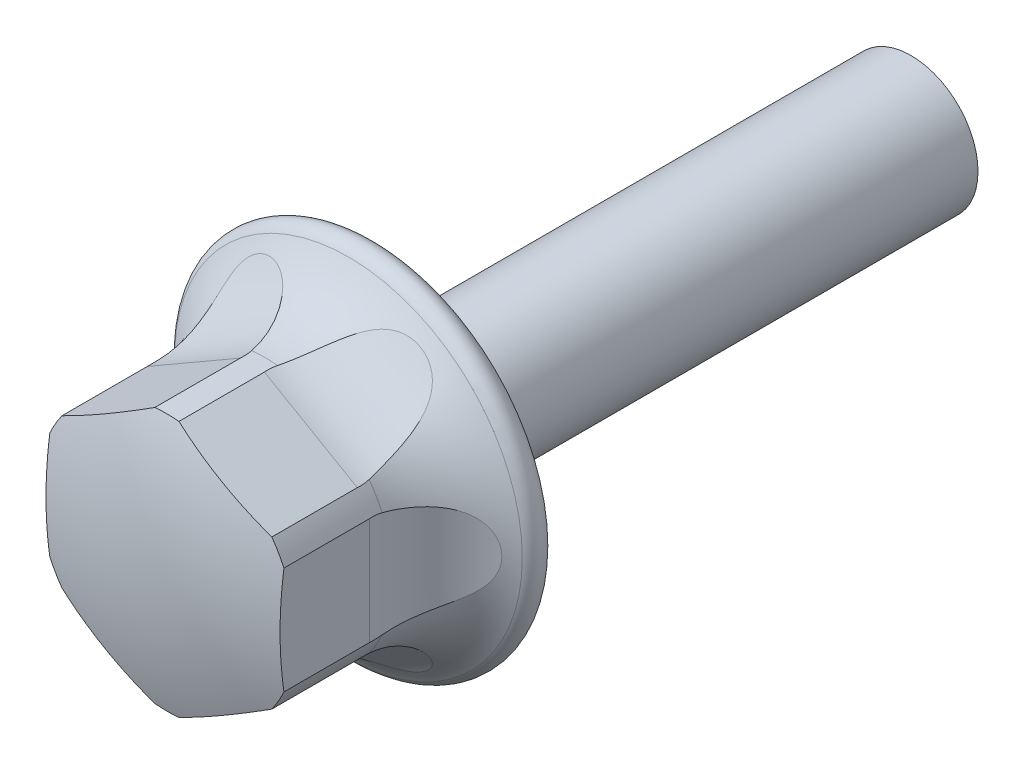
ISO-10303-21;
HEADER;
FILE_DESCRIPTION(('STEP AP214'),'2;1');
FILE_NAME('part.step','',(''),(''),'','','');
FILE_SCHEMA(('AUTOMOTIVE_DESIGN { 1 0 10303 214 1 1 1 1 }'));
ENDSEC;
DATA;
#1=APPLICATION_CONTEXT('core data for automotive mechanical design processes');
#2=APPLICATION_PROTOCOL_DEFINITION('international standard','automotive_design',2000,#1);
#3=PRODUCT_CONTEXT('',#1,'mechanical');
#4=PRODUCT('Part','Part','',(#3));
#5=PRODUCT_RELATED_PRODUCT_CATEGORY('part','',(#4));
#6=PRODUCT_DEFINITION_FORMATION('','',#4);
#7=PRODUCT_DEFINITION_CONTEXT('part definition',#1,'design');
#8=PRODUCT_DEFINITION('design','',#6,#7);
#9=PRODUCT_DEFINITION_SHAPE('','',#8);
#10=(LENGTH_UNIT() NAMED_UNIT(*) SI_UNIT(.MILLI.,.METRE.));
#11=(NAMED_UNIT(*) PLANE_ANGLE_UNIT() SI_UNIT($,.RADIAN.));
#12=(NAMED_UNIT(*) SI_UNIT($,.STERADIAN.) SOLID_ANGLE_UNIT());
#13=UNCERTAINTY_MEASURE_WITH_UNIT(LENGTH_MEASURE(1.E-05),#10,'distance_accuracy_value','');
#14=(GEOMETRIC_REPRESENTATION_CONTEXT(3) GLOBAL_UNCERTAINTY_ASSIGNED_CONTEXT((#13)) GLOBAL_UNIT_ASSIGNED_CONTEXT((#10,
#11,#12)) REPRESENTATION_CONTEXT('',''));
#15=CARTESIAN_POINT('',(0.,0.,0.));
#16=DIRECTION('',(0.,0.,1.));
#17=DIRECTION('',(1.,0.,0.));
#18=AXIS2_PLACEMENT_3D('',#15,#16,#17);
#19=CARTESIAN_POINT('',(0.,0.,0.));
#20=DIRECTION('',(0.,0.,1.));
#21=DIRECTION('',(1.,0.,0.));
#22=AXIS2_PLACEMENT_3D('',#19,#20,#21);
#23=CYLINDRICAL_SURFACE('',#22,3.85);
#24=DIRECTION('',(0.,0.,1.));
#25=VECTOR('',#24,1.);
#26=CARTESIAN_POINT('',(0.360980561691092,3.8330396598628,0.));
#27=LINE('',#26,#25);
#28=CARTESIAN_POINT('',(0.360980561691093,3.8330396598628,3.7));
#29=VERTEX_POINT('',#28);
#30=CARTESIAN_POINT('',(0.360980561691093,3.8330396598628,6.25454860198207));
#31=VERTEX_POINT('',#30);
#32=EDGE_CURVE('E284',#29,#31,#27,.T.);
#33=ORIENTED_EDGE('',*,*,#32,.F.);
#34=CARTESIAN_POINT('',(3.14133213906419,2.22587789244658,3.6));
#35=CARTESIAN_POINT('',(3.14132972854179,2.22588680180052,3.67209261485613));
#36=CARTESIAN_POINT('',(3.13772805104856,2.23099205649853,3.74427829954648));
#37=CARTESIAN_POINT('',(3.12329618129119,2.25114755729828,3.8866251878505));
#38=CARTESIAN_POINT('',(3.11244895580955,2.26622123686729,3.95678121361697));
#39=CARTESIAN_POINT('',(3.0835648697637,2.30536630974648,4.09278988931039));
#40=CARTESIAN_POINT('',(3.06554520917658,2.3294161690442,4.15865239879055));
#41=CARTESIAN_POINT('',(3.02242675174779,2.38509307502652,4.28453173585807));
#42=CARTESIAN_POINT('',(2.99733125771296,2.4167165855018,4.344551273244));
#43=CARTESIAN_POINT('',(2.93955899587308,2.48668377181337,4.45899291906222));
#44=CARTESIAN_POINT('',(2.90670406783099,2.52517918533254,4.51323167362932));
#45=CARTESIAN_POINT('',(2.834218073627,2.60627411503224,4.61347454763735));
#46=CARTESIAN_POINT('',(2.79458433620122,2.64887524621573,4.65947540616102));
#47=CARTESIAN_POINT('',(2.70521902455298,2.74020561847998,4.74668734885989));
#48=CARTESIAN_POINT('',(2.65489561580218,2.7891390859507,4.78707640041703));
#49=CARTESIAN_POINT('',(2.5477903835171,2.88730860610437,4.85760178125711));
#50=CARTESIAN_POINT('',(2.49100544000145,2.93654479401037,4.88773312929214));
#51=CARTESIAN_POINT('',(2.36485016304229,3.03930226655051,4.94098195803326));
#52=CARTESIAN_POINT('',(2.29478688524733,3.09263171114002,4.96282947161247));
#53=CARTESIAN_POINT('',(2.14930325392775,3.19545725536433,4.994345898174));
#54=CARTESIAN_POINT('',(2.07388008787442,3.2449513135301,5.0040083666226));
#55=CARTESIAN_POINT('',(1.91182641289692,3.34323636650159,5.01171324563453));
#56=CARTESIAN_POINT('',(1.82481601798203,3.39150087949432,5.00854732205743));
#57=CARTESIAN_POINT('',(1.64867265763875,3.48053494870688,4.98772705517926));
#58=CARTESIAN_POINT('',(1.55953898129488,3.52130195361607,4.97006779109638));
#59=CARTESIAN_POINT('',(1.3806473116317,3.59524964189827,4.9194149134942));
#60=CARTESIAN_POINT('',(1.29090203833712,3.62829894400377,4.88618119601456));
#61=CARTESIAN_POINT('',(1.11607614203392,3.68582821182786,4.80375685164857));
#62=CARTESIAN_POINT('',(1.03099276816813,3.71031327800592,4.75457575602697));
#63=CARTESIAN_POINT('',(0.876776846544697,3.74961025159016,4.64496546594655));
#64=CARTESIAN_POINT('',(0.806906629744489,3.76505601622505,4.58580750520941));
#65=CARTESIAN_POINT('',(0.678931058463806,3.7902259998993,4.45487866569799));
#66=CARTESIAN_POINT('',(0.620813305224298,3.79995626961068,4.38312123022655));
#67=CARTESIAN_POINT('',(0.526577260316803,3.81407903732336,4.23906105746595));
#68=CARTESIAN_POINT('',(0.488584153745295,3.81899981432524,4.16803379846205));
#69=CARTESIAN_POINT('',(0.426275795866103,3.82645839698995,4.02009144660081));
#70=CARTESIAN_POINT('',(0.401953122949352,3.8289974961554,3.94317957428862));
#71=CARTESIAN_POINT('',(0.369819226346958,3.83222761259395,3.79338854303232));
#72=CARTESIAN_POINT('',(0.36069113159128,3.83306758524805,3.72079246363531));
#73=CARTESIAN_POINT('',(0.355138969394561,3.83358665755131,3.57511986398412));
#74=CARTESIAN_POINT('',(0.358711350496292,3.83326608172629,3.50204348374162));
#75=CARTESIAN_POINT('',(0.378082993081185,3.83140185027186,3.35993726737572));
#76=CARTESIAN_POINT('',(0.393488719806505,3.82989752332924,3.29085270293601));
#77=CARTESIAN_POINT('',(0.43541385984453,3.82535691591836,3.15620987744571));
#78=CARTESIAN_POINT('',(0.461932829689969,3.82232069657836,3.09065147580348));
#79=CARTESIAN_POINT('',(0.525482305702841,3.8141059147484,2.9637516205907));
#80=CARTESIAN_POINT('',(0.562666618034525,3.80889545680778,2.90248951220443));
#81=CARTESIAN_POINT('',(0.645851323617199,3.79567451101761,2.78663451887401));
#82=CARTESIAN_POINT('',(0.691853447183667,3.78766347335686,2.73204294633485));
#83=CARTESIAN_POINT('',(0.793941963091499,3.76762742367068,2.62730956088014));
#84=CARTESIAN_POINT('',(0.850472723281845,3.75538709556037,2.57764331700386));
#85=CARTESIAN_POINT('',(0.969298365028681,3.72648654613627,2.48733296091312));
#86=CARTESIAN_POINT('',(1.03159558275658,3.70982452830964,2.44669252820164));
#87=CARTESIAN_POINT('',(1.16665056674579,3.66972569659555,2.37073273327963));
#88=CARTESIAN_POINT('',(1.23981909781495,3.64576027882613,2.33642416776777));
#89=CARTESIAN_POINT('',(1.38823431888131,3.59187298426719,2.27873434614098));
#90=CARTESIAN_POINT('',(1.46348205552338,3.56194805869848,2.25535870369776));
#91=CARTESIAN_POINT('',(1.62292979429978,3.49242319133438,2.21708076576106));
#92=CARTESIAN_POINT('',(1.70713440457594,3.45209709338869,2.2035101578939));
#93=CARTESIAN_POINT('',(1.87322046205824,3.36487137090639,2.18933908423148));
#94=CARTESIAN_POINT('',(1.95510068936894,3.31796836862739,2.18874530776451));
#95=CARTESIAN_POINT('',(2.1203235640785,3.21509841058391,2.20095385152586));
#96=CARTESIAN_POINT('',(2.2033417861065,3.15872083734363,2.21473059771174));
#97=CARTESIAN_POINT('',(2.36220399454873,3.04174621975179,2.25758442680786));
#98=CARTESIAN_POINT('',(2.43804730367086,2.9811487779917,2.28666295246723));
#99=CARTESIAN_POINT('',(2.57902416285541,2.85999818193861,2.3599068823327));
#100=CARTESIAN_POINT('',(2.64434850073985,2.79947059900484,2.40374408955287));
#101=CARTESIAN_POINT('',(2.76433887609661,2.68104952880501,2.50686671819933));
#102=CARTESIAN_POINT('',(2.81901589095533,2.62315337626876,2.56613608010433));
#103=CARTESIAN_POINT('',(2.9109311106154,2.52055788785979,2.69208328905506));
#104=CARTESIAN_POINT('',(2.94942597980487,2.47510744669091,2.75722909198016));
#105=CARTESIAN_POINT('',(3.01615970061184,2.39334071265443,2.89778338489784));
#106=CARTESIAN_POINT('',(3.0444018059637,2.35702152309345,2.97318860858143));
#107=CARTESIAN_POINT('',(3.08744702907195,2.30027918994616,3.12193102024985));
#108=CARTESIAN_POINT('',(3.10347518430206,2.27845103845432,3.19438350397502));
#109=CARTESIAN_POINT('',(3.12728289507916,2.24566806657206,3.3428671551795));
#110=CARTESIAN_POINT('',(3.13508644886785,2.23468161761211,3.41888723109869));
#111=CARTESIAN_POINT('',(3.14049004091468,2.22706492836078,3.53018309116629));
#112=CARTESIAN_POINT('',(3.14133330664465,2.2258735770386,3.56508062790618));
#113=CARTESIAN_POINT('',(3.14133213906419,2.22587789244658,3.6));
#114=B_SPLINE_CURVE_WITH_KNOTS('',3,(#34,#35,#36,#37,#38,#39,#40,#41,#42,#43,#44,#45,#46,#47,
#48,#49,#50,#51,#52,#53,#54,#55,#56,#57,#58,#59,#60,#61,#62,#63,#64,#65,#66,#67,#68,#69,#70,#71,
#72,#73,#74,#75,#76,#77,#78,#79,#80,#81,#82,#83,#84,#85,#86,#87,#88,#89,#90,#91,#92,#93,#94,#95,
#96,#97,#98,#99,#100,#101,#102,#103,#104,#105,#106,#107,#108,#109,#110,#111,#112,#113),
.UNSPECIFIED.,.T.,.F.,(4,2,2,2,2,2,2,2,2,2,2,2,2,2,2,2,2,2,2,2,2,2,2,2,2,2,2,2,2,2,2,2,2,2,2,2,
2,2,2,4),(0.,0.216172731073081,0.432855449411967,0.64902164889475,0.865087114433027,
1.08670191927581,1.3084042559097,1.55036947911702,1.79245203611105,2.06348945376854,
2.33467016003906,2.63195985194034,2.92935052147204,3.23148484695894,3.5334389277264,
3.81034897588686,4.08696534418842,4.32773862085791,4.56838105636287,4.78681066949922,
5.00517920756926,5.21658420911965,5.42798077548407,5.64259400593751,5.85724939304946,
6.08501804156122,6.3128793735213,6.56473225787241,6.81671431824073,7.09854455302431,
7.38052006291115,7.68294063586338,7.9853897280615,8.28151430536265,8.57733194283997,
8.84061034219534,9.10380511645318,9.33465462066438,9.56482865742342,9.66953586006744),.UNSPECIFIED.);
#115=CARTESIAN_POINT('',(0.38626604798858,3.83057417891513,3.33));
#116=VERTEX_POINT('',#115);
#117=EDGE_CURVE('E369',#29,#116,#114,.T.);
#118=ORIENTED_EDGE('',*,*,#117,.T.);
#119=CARTESIAN_POINT('',(0.,0.,3.33));
#120=DIRECTION('',(0.,0.,1.));
#121=DIRECTION('',(1.,0.,0.));
#122=AXIS2_PLACEMENT_3D('',#119,#120,#121);
#123=CIRCLE('',#122,3.85);
#124=CARTESIAN_POINT('',(-0.386266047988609,3.83057417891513,3.33));
#125=VERTEX_POINT('',#124);
#126=EDGE_CURVE('E266',#116,#125,#123,.T.);
#127=ORIENTED_EDGE('',*,*,#126,.T.);
#128=CARTESIAN_POINT('',(-0.357000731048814,3.83341238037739,3.6));
#129=CARTESIAN_POINT('',(-0.357009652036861,3.83341474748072,3.67209261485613));
#130=CARTESIAN_POINT('',(-0.36323177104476,3.83284823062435,3.74427829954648));
#131=CARTESIAN_POINT('',(-0.387902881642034,3.83042761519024,3.8866251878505));
#132=CARTESIAN_POINT('',(-0.406380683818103,3.82857048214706,3.95678121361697));
#133=CARTESIAN_POINT('',(-0.454723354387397,3.82312866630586,4.09278988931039));
#134=CARTESIAN_POINT('',(-0.484560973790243,3.8195481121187,4.15865239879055));
#135=CARTESIAN_POINT('',(-0.554337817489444,3.81004488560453,4.28453173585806));
#136=CARTESIAN_POINT('',(-0.594272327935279,3.80412330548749,4.34455127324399));
#137=CARTESIAN_POINT('',(-0.683751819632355,3.78907465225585,4.45899291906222));
#138=CARTESIAN_POINT('',(-0.733517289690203,3.77986915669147,4.51323167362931));
#139=CARTESIAN_POINT('',(-0.839990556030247,3.75764190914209,4.61347454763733));
#140=CARTESIAN_POINT('',(-0.896701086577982,3.74461865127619,4.65947540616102));
#141=CARTESIAN_POINT('',(-1.02047816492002,3.71289120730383,4.74668734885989));
#142=CARTESIAN_POINT('',(-1.08801749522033,3.69377659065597,4.78707640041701));
#143=CARTESIAN_POINT('',(-1.22658740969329,3.65010549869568,4.85760178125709));
#144=CARTESIAN_POINT('',(-1.29761967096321,3.62554638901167,4.88773312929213));
#145=CARTESIAN_POINT('',(-1.44968789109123,3.56767145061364,4.94098195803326));
#146=CARTESIAN_POINT('',(-1.53090418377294,3.53365959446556,4.96282947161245));
#147=CARTESIAN_POINT('',(-1.69269553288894,3.45907984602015,4.99434589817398));
#148=CARTESIAN_POINT('',(-1.77327022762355,3.41850849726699,5.0040083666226));
#149=CARTESIAN_POINT('',(-1.9394144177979,3.3273084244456,5.01171324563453));
#150=CARTESIAN_POINT('',(-2.02471790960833,3.27608746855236,5.00854732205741));
#151=CARTESIAN_POINT('',(-2.18989535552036,3.16805987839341,4.98772705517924));
#152=CARTESIAN_POINT('',(-2.26976745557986,3.1112513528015,4.97006779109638));
#153=CARTESIAN_POINT('',(-2.42325386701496,2.99330046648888,4.9194149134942));
#154=CARTESIAN_POINT('',(-2.49674803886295,2.93210343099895,4.88618119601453));
#155=CARTESIAN_POINT('',(-2.63398279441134,2.80946439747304,4.80375685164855));
#156=CARTESIAN_POINT('',(-2.69772917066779,2.7480225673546,4.75457575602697));
#157=CARTESIAN_POINT('',(-2.80886930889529,2.6341161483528,4.64496546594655));
#158=CARTESIAN_POINT('',(-2.85718084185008,2.58132964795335,4.5858075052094));
#159=CARTESIAN_POINT('',(-2.94296647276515,2.48308454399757,4.45487866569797));
#160=CARTESIAN_POINT('',(-2.98045201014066,2.43761822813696,4.38312123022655));
#161=CARTESIAN_POINT('',(-3.03980070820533,2.36306880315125,4.23906105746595));
#162=CARTESIAN_POINT('',(-3.06305877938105,2.33262619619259,4.16803379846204));
#163=CARTESIAN_POINT('',(-3.10067228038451,2.28239486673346,4.0200914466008));
#164=CARTESIAN_POINT('',(-3.11503254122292,2.26260036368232,3.94317957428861));
#165=CARTESIAN_POINT('',(-3.13389685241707,2.23638665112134,3.79338854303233));
#166=CARTESIAN_POINT('',(-3.13918833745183,2.22890147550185,3.72079246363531));
#167=CARTESIAN_POINT('',(-3.14241394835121,2.22435269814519,3.57511986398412));
#168=CARTESIAN_POINT('',(-3.14035013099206,2.22728618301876,3.50204348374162));
#169=CARTESIAN_POINT('',(-3.12904983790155,2.24313040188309,3.35993726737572));
#170=CARTESIAN_POINT('',(-3.12004418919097,2.25571998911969,3.29085270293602));
#171=CARTESIAN_POINT('',(-3.09514933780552,2.2897579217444,3.15620987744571));
#172=CARTESIAN_POINT('',(-3.0792604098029,2.31120591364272,3.09065147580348));
#173=CARTESIAN_POINT('',(-3.04037146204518,2.36213398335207,2.9637516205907));
#174=CARTESIAN_POINT('',(-3.0172669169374,2.39173131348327,2.90248951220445));
#175=CARTESIAN_POINT('',(-2.96422488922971,2.45716090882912,2.78663451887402));
#176=CARTESIAN_POINT('',(-2.93428606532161,2.49299439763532,2.73204294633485));
#177=CARTESIAN_POINT('',(-2.86589007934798,2.57138762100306,2.62730956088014));
#178=CARTESIAN_POINT('',(-2.82702426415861,2.614224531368,2.57764331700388));
#179=CARTESIAN_POINT('',(-2.7425828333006,2.7026802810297,2.48733296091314));
#180=CARTESIAN_POINT('',(-2.69700449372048,2.74830024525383,2.44669252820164));
#181=CARTESIAN_POINT('',(-2.5947503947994,2.84521187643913,2.37073273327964));
#182=CARTESIAN_POINT('',(-2.5374114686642,2.89659497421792,2.33642416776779));
#183=CARTESIAN_POINT('',(-2.41653609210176,2.99818267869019,2.278734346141));
#184=CARTESIAN_POINT('',(-2.35299647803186,3.04838666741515,2.25535870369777));
#185=CARTESIAN_POINT('',(-2.21306230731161,3.15171002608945,2.21708076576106));
#186=CARTESIAN_POINT('',(-2.13603657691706,3.20447030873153,2.20351015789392));
#187=CARTESIAN_POINT('',(-1.9774538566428,3.30469219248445,2.1893390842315));
#188=CARTESIAN_POINT('',(-1.89589455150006,3.35215104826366,2.18874530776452));
#189=CARTESIAN_POINT('',(-1.7241951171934,3.44380327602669,2.20095385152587));
#190=CARTESIAN_POINT('',(-1.6338615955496,3.48751037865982,2.21473059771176));
#191=CARTESIAN_POINT('',(-1.45312750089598,3.56660177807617,2.25758442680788));
#192=CARTESIAN_POINT('',(-1.36272692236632,3.60198528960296,2.28666295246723));
#193=CARTESIAN_POINT('',(-1.18731899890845,3.66349953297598,2.3599068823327));
#194=CARTESIAN_POINT('',(-1.10223840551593,3.68980827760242,2.40374408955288));
#195=CARTESIAN_POINT('',(-0.939687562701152,3.73451245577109,2.50686671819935));
#196=CARTESIAN_POINT('',(-0.862209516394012,3.75291606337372,2.56613608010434));
#197=CARTESIAN_POINT('',(-0.727401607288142,3.78121923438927,2.69208328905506));
#198=CARTESIAN_POINT('',(-0.668792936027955,3.79183154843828,2.75722909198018));
#199=CARTESIAN_POINT('',(-0.56461400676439,3.80874127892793,2.89778338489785));
#200=CARTESIAN_POINT('',(-0.519039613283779,3.81504006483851,2.97318860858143));
#201=CARTESIAN_POINT('',(-0.448376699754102,3.82394715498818,3.12193102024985));
#202=CARTESIAN_POINT('',(-0.421458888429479,3.82691386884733,3.19438350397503));
#203=CARTESIAN_POINT('',(-0.381164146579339,3.83114046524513,3.34286715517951));
#204=CARTESIAN_POINT('',(-0.367747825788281,3.83240531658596,3.41888723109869));
#205=CARTESIAN_POINT('',(-0.35844978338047,3.83327661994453,3.53018309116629));
#206=CARTESIAN_POINT('',(-0.356996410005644,3.83341123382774,3.56508062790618));
#207=CARTESIAN_POINT('',(-0.357000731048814,3.83341238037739,3.6));
#208=B_SPLINE_CURVE_WITH_KNOTS('',3,(#128,#129,#130,#131,#132,#133,#134,#135,#136,#137,#138,
#139,#140,#141,#142,#143,#144,#145,#146,#147,#148,#149,#150,#151,#152,#153,#154,#155,#156,#157,
#158,#159,#160,#161,#162,#163,#164,#165,#166,#167,#168,#169,#170,#171,#172,#173,#174,#175,#176,
#177,#178,#179,#180,#181,#182,#183,#184,#185,#186,#187,#188,#189,#190,#191,#192,#193,#194,#195,
#196,#197,#198,#199,#200,#201,#202,#203,#204,#205,#206,#207),.UNSPECIFIED.,.T.,.F.,(4,2,2,2,2,2,
2,2,2,2,2,2,2,2,2,2,2,2,2,2,2,2,2,2,2,2,2,2,2,2,2,2,2,2,2,2,2,2,2,4),(0.,0.21617273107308,
0.432855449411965,0.649021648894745,0.865087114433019,1.0867019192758,1.30840425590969,
1.550369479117,1.79245203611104,2.06348945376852,2.33467016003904,2.63195985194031,
2.92935052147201,3.23148484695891,3.53343892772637,3.81034897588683,4.08696534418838,
4.32773862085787,4.56838105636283,4.78681066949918,5.00517920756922,5.2165842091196,
5.42798077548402,5.64259400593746,5.8572493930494,6.08501804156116,6.31287937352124,
6.56473225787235,6.81671431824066,7.09854455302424,7.38052006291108,7.68294063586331,
7.98538972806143,8.28151430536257,8.57733194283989,8.84061034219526,9.10380511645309,
9.33465462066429,9.56482865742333,9.66953586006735),.UNSPECIFIED.);
#209=CARTESIAN_POINT('',(-0.360980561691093,3.83303965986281,3.7));
#210=VERTEX_POINT('',#209);
#211=EDGE_CURVE('E358',#125,#210,#208,.T.);
#212=ORIENTED_EDGE('',*,*,#211,.T.);
#213=DIRECTION('',(0.,0.,1.));
#214=VECTOR('',#213,1.);
#215=CARTESIAN_POINT('',(-0.360980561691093,3.8330396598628,0.));
#216=LINE('',#215,#214);
#217=CARTESIAN_POINT('',(-0.360980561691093,3.83303965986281,6.25454860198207));
#218=VERTEX_POINT('',#217);
#219=EDGE_CURVE('E287',#218,#210,#216,.F.);
#220=ORIENTED_EDGE('',*,*,#219,.F.);
#221=CARTESIAN_POINT('',(0.,0.,6.25454860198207));
#222=DIRECTION('',(0.,0.,1.));
#223=DIRECTION('',(1.,0.,0.));
#224=AXIS2_PLACEMENT_3D('',#221,#222,#223);
#225=CIRCLE('',#224,3.85);
#226=EDGE_CURVE('E280',#31,#218,#225,.T.);
#227=ORIENTED_EDGE('',*,*,#226,.F.);
#228=EDGE_LOOP('',(#33,#118,#127,#212,#220,#227));
#229=FACE_BOUND('',#228,.T.);
#230=ADVANCED_FACE('F16',(#229),#23,.T.);
#231=DIRECTION('',(0.,0.,1.));
#232=VECTOR('',#231,1.);
#233=CARTESIAN_POINT('',(3.13901943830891,-2.22913816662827,0.));
#234=LINE('',#233,#232);
#235=CARTESIAN_POINT('',(3.13901943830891,-2.22913816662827,3.7));
#236=VERTEX_POINT('',#235);
#237=CARTESIAN_POINT('',(3.13901943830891,-2.22913816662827,6.25454860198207));
#238=VERTEX_POINT('',#237);
#239=EDGE_CURVE('E172',#236,#238,#234,.T.);
#240=ORIENTED_EDGE('',*,*,#239,.F.);
#241=CARTESIAN_POINT('',(0.357000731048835,-3.83341238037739,3.6));
#242=CARTESIAN_POINT('',(0.357009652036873,-3.83341474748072,3.67209261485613));
#243=CARTESIAN_POINT('',(0.363231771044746,-3.83284823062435,3.74427829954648));
#244=CARTESIAN_POINT('',(0.387902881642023,-3.83042761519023,3.8866251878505));
#245=CARTESIAN_POINT('',(0.406380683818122,-3.82857048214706,3.95678121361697));
#246=CARTESIAN_POINT('',(0.454723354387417,-3.82312866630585,4.09278988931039));
#247=CARTESIAN_POINT('',(0.484560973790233,-3.8195481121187,4.15865239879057));
#248=CARTESIAN_POINT('',(0.554337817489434,-3.81004488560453,4.28453173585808));
#249=CARTESIAN_POINT('',(0.594272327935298,-3.80412330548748,4.34455127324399));
#250=CARTESIAN_POINT('',(0.68375181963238,-3.78907465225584,4.45899291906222));
#251=CARTESIAN_POINT('',(0.733517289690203,-3.77986915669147,4.51323167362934));
#252=CARTESIAN_POINT('',(0.839990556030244,-3.75764190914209,4.61347454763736));
#253=CARTESIAN_POINT('',(0.896701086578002,-3.74461865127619,4.65947540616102));
#254=CARTESIAN_POINT('',(1.02047816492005,-3.71289120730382,4.74668734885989));
#255=CARTESIAN_POINT('',(1.08801749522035,-3.69377659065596,4.78707640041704));
#256=CARTESIAN_POINT('',(1.22658740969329,-3.65010549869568,4.85760178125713));
#257=CARTESIAN_POINT('',(1.29761967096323,-3.62554638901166,4.88773312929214));
#258=CARTESIAN_POINT('',(1.44968789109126,-3.56767145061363,4.94098195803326));
#259=CARTESIAN_POINT('',(1.53090418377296,-3.53365959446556,4.96282947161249));
#260=CARTESIAN_POINT('',(1.69269553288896,-3.45907984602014,4.99434589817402));
#261=CARTESIAN_POINT('',(1.77327022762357,-3.41850849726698,5.0040083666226));
#262=CARTESIAN_POINT('',(1.93941441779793,-3.32730842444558,5.01171324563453));
#263=CARTESIAN_POINT('',(2.02471790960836,-3.27608746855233,5.00854732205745));
#264=CARTESIAN_POINT('',(2.18989535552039,-3.16805987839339,4.98772705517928));
#265=CARTESIAN_POINT('',(2.26976745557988,-3.11125135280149,4.97006779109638));
#266=CARTESIAN_POINT('',(2.42325386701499,-2.99330046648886,4.9194149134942));
#267=CARTESIAN_POINT('',(2.496748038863,-2.93210343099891,4.88618119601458));
#268=CARTESIAN_POINT('',(2.63398279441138,-2.809464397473,4.80375685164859));
#269=CARTESIAN_POINT('',(2.6977291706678,-2.74802256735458,4.75457575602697));
#270=CARTESIAN_POINT('',(2.80886930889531,-2.63411614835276,4.64496546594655));
#271=CARTESIAN_POINT('',(2.85718084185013,-2.58132964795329,4.58580750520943));
#272=CARTESIAN_POINT('',(2.9429664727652,-2.48308454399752,4.45487866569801));
#273=CARTESIAN_POINT('',(2.98045201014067,-2.43761822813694,4.38312123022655));
#274=CARTESIAN_POINT('',(3.03980070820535,-2.36306880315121,4.23906105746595));
#275=CARTESIAN_POINT('',(3.06305877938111,-2.33262619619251,4.16803379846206));
#276=CARTESIAN_POINT('',(3.10067228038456,-2.2823948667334,4.02009144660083));
#277=CARTESIAN_POINT('',(3.11503254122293,-2.2626003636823,3.94317957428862));
#278=CARTESIAN_POINT('',(3.13389685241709,-2.23638665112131,3.79338854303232));
#279=CARTESIAN_POINT('',(3.13918833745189,-2.22890147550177,3.72079246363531));
#280=CARTESIAN_POINT('',(3.14241394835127,-2.22435269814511,3.57511986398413));
#281=CARTESIAN_POINT('',(3.14035013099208,-2.22728618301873,3.50204348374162));
#282=CARTESIAN_POINT('',(3.12904983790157,-2.24313040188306,3.35993726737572));
#283=CARTESIAN_POINT('',(3.12004418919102,-2.25571998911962,3.290852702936));
#284=CARTESIAN_POINT('',(3.09514933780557,-2.28975792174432,3.1562098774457));
#285=CARTESIAN_POINT('',(3.07926040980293,-2.31120591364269,3.09065147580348));
#286=CARTESIAN_POINT('',(3.0403714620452,-2.36213398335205,2.9637516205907));
#287=CARTESIAN_POINT('',(3.01726691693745,-2.39173131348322,2.90248951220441));
#288=CARTESIAN_POINT('',(2.96422488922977,-2.45716090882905,2.78663451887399));
#289=CARTESIAN_POINT('',(2.93428606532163,-2.49299439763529,2.73204294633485));
#290=CARTESIAN_POINT('',(2.86589007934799,-2.57138762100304,2.62730956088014));
#291=CARTESIAN_POINT('',(2.82702426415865,-2.61422453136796,2.57764331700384));
#292=CARTESIAN_POINT('',(2.74258283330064,-2.70268028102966,2.4873329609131));
#293=CARTESIAN_POINT('',(2.69700449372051,-2.7483002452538,2.44669252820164));
#294=CARTESIAN_POINT('',(2.59475039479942,-2.84521187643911,2.37073273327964));
#295=CARTESIAN_POINT('',(2.53741146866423,-2.89659497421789,2.33642416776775));
#296=CARTESIAN_POINT('',(2.41653609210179,-2.99818267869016,2.27873434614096));
#297=CARTESIAN_POINT('',(2.35299647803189,-3.04838666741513,2.25535870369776));
#298=CARTESIAN_POINT('',(2.21306230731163,-3.15171002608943,2.21708076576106));
#299=CARTESIAN_POINT('',(2.13603657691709,-3.20447030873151,2.20351015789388));
#300=CARTESIAN_POINT('',(1.97745385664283,-3.30469219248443,2.18933908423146));
#301=CARTESIAN_POINT('',(1.89589455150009,-3.35215104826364,2.18874530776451));
#302=CARTESIAN_POINT('',(1.72419511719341,-3.44380327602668,2.20095385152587));
#303=CARTESIAN_POINT('',(1.63386159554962,-3.48751037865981,2.21473059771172));
#304=CARTESIAN_POINT('',(1.45312750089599,-3.56660177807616,2.25758442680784));
#305=CARTESIAN_POINT('',(1.36272692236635,-3.60198528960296,2.28666295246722));
#306=CARTESIAN_POINT('',(1.18731899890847,-3.66349953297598,2.35990688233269));
#307=CARTESIAN_POINT('',(1.10223840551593,-3.68980827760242,2.40374408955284));
#308=CARTESIAN_POINT('',(0.93968756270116,-3.73451245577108,2.50686671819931));
#309=CARTESIAN_POINT('',(0.862209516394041,-3.75291606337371,2.56613608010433));
#310=CARTESIAN_POINT('',(0.727401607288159,-3.78121923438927,2.69208328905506));
#311=CARTESIAN_POINT('',(0.668792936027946,-3.79183154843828,2.75722909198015));
#312=CARTESIAN_POINT('',(0.564614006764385,-3.80874127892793,2.89778338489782));
#313=CARTESIAN_POINT('',(0.519039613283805,-3.8150400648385,2.97318860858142));
#314=CARTESIAN_POINT('',(0.448376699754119,-3.82394715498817,3.12193102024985));
#315=CARTESIAN_POINT('',(0.421458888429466,-3.82691386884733,3.19438350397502));
#316=CARTESIAN_POINT('',(0.381164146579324,-3.83114046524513,3.34286715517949));
#317=CARTESIAN_POINT('',(0.367747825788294,-3.83240531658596,3.41888723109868));
#318=CARTESIAN_POINT('',(0.358449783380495,-3.83327661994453,3.53018309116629));
#319=CARTESIAN_POINT('',(0.356996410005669,-3.83341123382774,3.56508062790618));
#320=CARTESIAN_POINT('',(0.357000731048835,-3.83341238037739,3.6));
#321=B_SPLINE_CURVE_WITH_KNOTS('',3,(#241,#242,#243,#244,#245,#246,#247,#248,#249,#250,#251,
#252,#253,#254,#255,#256,#257,#258,#259,#260,#261,#262,#263,#264,#265,#266,#267,#268,#269,#270,
#271,#272,#273,#274,#275,#276,#277,#278,#279,#280,#281,#282,#283,#284,#285,#286,#287,#288,#289,
#290,#291,#292,#293,#294,#295,#296,#297,#298,#299,#300,#301,#302,#303,#304,#305,#306,#307,#308,
#309,#310,#311,#312,#313,#314,#315,#316,#317,#318,#319,#320),.UNSPECIFIED.,.T.,.F.,(4,2,2,2,2,2,
2,2,2,2,2,2,2,2,2,2,2,2,2,2,2,2,2,2,2,2,2,2,2,2,2,2,2,2,2,2,2,2,2,4),(0.,0.216172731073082,
0.432855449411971,0.649021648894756,0.865087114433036,1.08670191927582,1.30840425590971,
1.55036947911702,1.79245203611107,2.06348945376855,2.33467016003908,2.63195985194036,
2.92935052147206,3.23148484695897,3.53343892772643,3.81034897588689,4.08696534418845,
4.32773862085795,4.56838105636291,4.78681066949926,5.00517920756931,5.2165842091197,
5.42798077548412,5.64259400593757,5.85724939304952,6.08501804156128,6.31287937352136,
6.56473225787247,6.81671431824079,7.09854455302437,7.38052006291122,7.68294063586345,
7.98538972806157,8.28151430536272,8.57733194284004,8.84061034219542,9.10380511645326,
9.33465462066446,9.5648286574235,9.66953586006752),.UNSPECIFIED.);
#322=CARTESIAN_POINT('',(3.12424152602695,-2.24980329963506,3.33));
#323=VERTEX_POINT('',#322);
#324=EDGE_CURVE('E147',#236,#323,#321,.T.);
#325=ORIENTED_EDGE('',*,*,#324,.T.);
#326=CARTESIAN_POINT('',(3.51050757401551,-1.58077087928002,3.33));
#327=VERTEX_POINT('',#326);
#328=EDGE_CURVE('E268',#323,#327,#123,.T.);
#329=ORIENTED_EDGE('',*,*,#328,.T.);
#330=CARTESIAN_POINT('',(3.51050757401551,-1.58077087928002,3.33));
#331=CARTESIAN_POINT('',(3.50736845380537,-1.58773583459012,3.36470736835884));
#332=CARTESIAN_POINT('',(3.50481753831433,-1.59335256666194,3.39972194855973));
#333=CARTESIAN_POINT('',(3.50093735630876,-1.60186234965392,3.47014589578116));
#334=CARTESIAN_POINT('',(3.4996080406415,-1.6047555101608,3.50555524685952));
#335=CARTESIAN_POINT('',(3.49752355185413,-1.60930179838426,3.61187097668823));
#336=CARTESIAN_POINT('',(3.4986555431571,-1.60685714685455,3.68304252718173));
#337=CARTESIAN_POINT('',(3.50586673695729,-1.59105899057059,3.82390497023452));
#338=CARTESIAN_POINT('',(3.51194853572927,-1.57769976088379,3.8935950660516));
#339=CARTESIAN_POINT('',(3.52845398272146,-1.54042986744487,4.02954284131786));
#340=CARTESIAN_POINT('',(3.53887711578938,-1.51652045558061,4.09580092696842));
#341=CARTESIAN_POINT('',(3.56315059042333,-1.45857658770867,4.2236823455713));
#342=CARTESIAN_POINT('',(3.57702732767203,-1.42446372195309,4.28526497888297));
#343=CARTESIAN_POINT('',(3.60685553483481,-1.34714718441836,4.40186488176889));
#344=CARTESIAN_POINT('',(3.62280767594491,-1.30394056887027,4.45688001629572));
#345=CARTESIAN_POINT('',(3.65634404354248,-1.20682786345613,4.56247270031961));
#346=CARTESIAN_POINT('',(3.67396889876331,-1.15243799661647,4.61259120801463));
#347=CARTESIAN_POINT('',(3.70837735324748,-1.03638904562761,4.70387204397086));
#348=CARTESIAN_POINT('',(3.72516066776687,-0.974727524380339,4.74503135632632));
#349=CARTESIAN_POINT('',(3.75817967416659,-0.839015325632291,4.82208960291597));
#350=CARTESIAN_POINT('',(3.77417647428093,-0.764343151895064,4.85699487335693));
#351=CARTESIAN_POINT('',(3.80215781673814,-0.610123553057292,4.91594254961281));
#352=CARTESIAN_POINT('',(3.81414021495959,-0.530573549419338,4.93997915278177));
#353=CARTESIAN_POINT('',(3.83432995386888,-0.358805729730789,4.97972898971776));
#354=CARTESIAN_POINT('',(3.84191909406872,-0.266206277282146,4.99411287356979));
#355=CARTESIAN_POINT('',(3.85031250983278,-0.0795869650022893,5.00998742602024));
#356=CARTESIAN_POINT('',(3.85111328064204,0.0144336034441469,5.01147143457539));
#357=CARTESIAN_POINT('',(3.84565718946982,0.208662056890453,5.00119839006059));
#358=CARTESIAN_POINT('',(3.83886611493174,0.308804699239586,4.98843918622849));
#359=CARTESIAN_POINT('',(3.81798689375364,0.505198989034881,4.94768946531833));
#360=CARTESIAN_POINT('',(3.80389807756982,0.60145027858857,4.91969755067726));
#361=CARTESIAN_POINT('',(3.77021282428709,0.785217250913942,4.84855081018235));
#362=CARTESIAN_POINT('',(3.75071701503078,0.872856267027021,4.80566971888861));
#363=CARTESIAN_POINT('',(3.70846633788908,1.03779381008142,4.70437115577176));
#364=CARTESIAN_POINT('',(3.68571418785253,1.11510085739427,4.64596660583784));
#365=CARTESIAN_POINT('',(3.64264043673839,1.24821797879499,4.52134337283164));
#366=CARTESIAN_POINT('',(3.62232083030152,1.30544628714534,4.45664253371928));
#367=CARTESIAN_POINT('',(3.58432807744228,1.40641866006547,4.31679483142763));
#368=CARTESIAN_POINT('',(3.56665206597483,1.45017737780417,4.24165944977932));
#369=CARTESIAN_POINT('',(3.53832905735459,1.51786316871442,4.09330816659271));
#370=CARTESIAN_POINT('',(3.5270804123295,1.54358277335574,4.02102122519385));
#371=CARTESIAN_POINT('',(3.50980666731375,1.58247228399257,3.87254804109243));
#372=CARTESIAN_POINT('',(3.50377955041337,1.59564703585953,3.79636331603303));
#373=CARTESIAN_POINT('',(3.49812117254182,1.60800549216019,3.65449602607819));
#374=CARTESIAN_POINT('',(3.49764727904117,1.60903269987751,3.58900466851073));
#375=CARTESIAN_POINT('',(3.50012573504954,1.60362722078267,3.49126749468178));
#376=CARTESIAN_POINT('',(3.50148511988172,1.60066401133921,3.45875338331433));
#377=CARTESIAN_POINT('',(3.50523322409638,1.59243762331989,3.39407203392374));
#378=CARTESIAN_POINT('',(3.50762210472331,1.58717408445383,3.36190485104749));
#379=CARTESIAN_POINT('',(3.51050757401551,1.58077087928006,3.33));
#380=B_SPLINE_CURVE_WITH_KNOTS('',3,(#330,#331,#332,#333,#334,#335,#336,#337,#338,#339,#340,
#341,#342,#343,#344,#345,#346,#347,#348,#349,#350,#351,#352,#353,#354,#355,#356,#357,#358,#359,
#360,#361,#362,#363,#364,#365,#366,#367,#368,#369,#370,#371,#372,#373,#374,#375,#376,#377,#378,
#379),.UNSPECIFIED.,.F.,.F.,(4,2,2,2,2,2,2,2,2,2,2,2,2,2,2,2,2,2,2,2,2,2,2,2,4),(0.,
0.106550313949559,0.213096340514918,0.425650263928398,0.638315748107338,0.850956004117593,
1.06527424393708,1.27966196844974,1.50681041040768,1.73403519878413,1.98491446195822,
2.23592750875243,2.51678405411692,2.79778559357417,3.0998773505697,3.40199682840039,
3.69883275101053,3.99542235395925,4.26008655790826,4.52446181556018,4.75587014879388,
4.98718905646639,5.18285377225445,5.2807976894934,5.37875695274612),.UNSPECIFIED.);
#381=CARTESIAN_POINT('',(3.5,-1.60390149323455,3.7));
#382=VERTEX_POINT('',#381);
#383=EDGE_CURVE('E327',#327,#382,#380,.T.);
#384=ORIENTED_EDGE('',*,*,#383,.T.);
#385=DIRECTION('',(0.,0.,1.));
#386=VECTOR('',#385,1.);
#387=CARTESIAN_POINT('',(3.5,-1.60390149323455,0.));
#388=LINE('',#387,#386);
#389=CARTESIAN_POINT('',(3.5,-1.60390149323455,6.25454860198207));
#390=VERTEX_POINT('',#389);
#391=EDGE_CURVE('E179',#390,#382,#388,.F.);
#392=ORIENTED_EDGE('',*,*,#391,.F.);
#393=EDGE_CURVE('E273',#238,#390,#225,.T.);
#394=ORIENTED_EDGE('',*,*,#393,.F.);
#395=EDGE_LOOP('',(#240,#325,#329,#384,#392,#394));
#396=FACE_BOUND('',#395,.T.);
#397=ADVANCED_FACE('F214',(#396),#23,.T.);
#398=CARTESIAN_POINT('',(-0.38626604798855,-3.83057417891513,3.33));
#399=VERTEX_POINT('',#398);
#400=CARTESIAN_POINT('',(0.386266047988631,-3.83057417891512,3.33));
#401=VERTEX_POINT('',#400);
#402=EDGE_CURVE('E164',#399,#401,#123,.T.);
#403=ORIENTED_EDGE('',*,*,#402,.T.);
#404=CARTESIAN_POINT('',(0.360980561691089,-3.83303965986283,3.7));
#405=VERTEX_POINT('',#404);
#406=EDGE_CURVE('E144',#401,#405,#321,.T.);
#407=ORIENTED_EDGE('',*,*,#406,.T.);
#408=DIRECTION('',(0.,0.,1.));
#409=VECTOR('',#408,1.);
#410=CARTESIAN_POINT('',(0.360980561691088,-3.83303965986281,0.));
#411=LINE('',#410,#409);
#412=CARTESIAN_POINT('',(0.360980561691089,-3.8330396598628,6.25454860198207));
#413=VERTEX_POINT('',#412);
#414=EDGE_CURVE('E160',#413,#405,#411,.F.);
#415=ORIENTED_EDGE('',*,*,#414,.F.);
#416=CARTESIAN_POINT('',(-0.360980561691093,-3.83303965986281,6.25454860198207));
#417=VERTEX_POINT('',#416);
#418=EDGE_CURVE('E315',#417,#413,#225,.T.);
#419=ORIENTED_EDGE('',*,*,#418,.F.);
#420=DIRECTION('',(0.,0.,1.));
#421=VECTOR('',#420,1.);
#422=CARTESIAN_POINT('',(-0.360980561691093,-3.8330396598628,0.));
#423=LINE('',#422,#421);
#424=CARTESIAN_POINT('',(-0.360980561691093,-3.83303965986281,3.7));
#425=VERTEX_POINT('',#424);
#426=EDGE_CURVE('E173',#425,#417,#423,.T.);
#427=ORIENTED_EDGE('',*,*,#426,.F.);
#428=CARTESIAN_POINT('',(-3.14133213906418,-2.22587789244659,3.6));
#429=CARTESIAN_POINT('',(-3.14132972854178,-2.22588680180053,3.67209261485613));
#430=CARTESIAN_POINT('',(-3.13772805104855,-2.23099205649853,3.74427829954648));
#431=CARTESIAN_POINT('',(-3.12329618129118,-2.2511475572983,3.8866251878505));
#432=CARTESIAN_POINT('',(-3.11244895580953,-2.26622123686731,3.95678121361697));
#433=CARTESIAN_POINT('',(-3.08356486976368,-2.3053663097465,4.09278988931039));
#434=CARTESIAN_POINT('',(-3.06554520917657,-2.32941616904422,4.15865239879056));
#435=CARTESIAN_POINT('',(-3.02242675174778,-2.38509307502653,4.28453173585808));
#436=CARTESIAN_POINT('',(-2.99733125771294,-2.41671658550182,4.34455127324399));
#437=CARTESIAN_POINT('',(-2.93955899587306,-2.48668377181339,4.45899291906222));
#438=CARTESIAN_POINT('',(-2.90670406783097,-2.52517918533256,4.51323167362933));
#439=CARTESIAN_POINT('',(-2.83421807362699,-2.60627411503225,4.61347454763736));
#440=CARTESIAN_POINT('',(-2.7945843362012,-2.64887524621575,4.65947540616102));
#441=CARTESIAN_POINT('',(-2.70521902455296,-2.74020561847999,4.74668734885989));
#442=CARTESIAN_POINT('',(-2.65489561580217,-2.78913908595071,4.78707640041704));
#443=CARTESIAN_POINT('',(-2.54779038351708,-2.88730860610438,4.85760178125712));
#444=CARTESIAN_POINT('',(-2.49100544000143,-2.93654479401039,4.88773312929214));
#445=CARTESIAN_POINT('',(-2.36485016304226,-3.03930226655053,4.94098195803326));
#446=CARTESIAN_POINT('',(-2.29478688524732,-3.09263171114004,4.96282947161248));
#447=CARTESIAN_POINT('',(-2.14930325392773,-3.19545725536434,4.99434589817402));
#448=CARTESIAN_POINT('',(-2.0738800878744,-3.24495131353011,5.0040083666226));
#449=CARTESIAN_POINT('',(-1.91182641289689,-3.3432363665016,5.01171324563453));
#450=CARTESIAN_POINT('',(-1.824816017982,-3.39150087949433,5.00854732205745));
#451=CARTESIAN_POINT('',(-1.64867265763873,-3.4805349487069,4.98772705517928));
#452=CARTESIAN_POINT('',(-1.55953898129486,-3.52130195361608,4.97006779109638));
#453=CARTESIAN_POINT('',(-1.38064731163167,-3.59524964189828,4.9194149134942));
#454=CARTESIAN_POINT('',(-1.29090203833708,-3.62829894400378,4.88618119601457));
#455=CARTESIAN_POINT('',(-1.11607614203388,-3.68582821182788,4.80375685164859));
#456=CARTESIAN_POINT('',(-1.03099276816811,-3.71031327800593,4.75457575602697));
#457=CARTESIAN_POINT('',(-0.876776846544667,-3.74961025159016,4.64496546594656));
#458=CARTESIAN_POINT('',(-0.806906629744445,-3.76505601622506,4.58580750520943));
#459=CARTESIAN_POINT('',(-0.678931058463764,-3.79022599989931,4.45487866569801));
#460=CARTESIAN_POINT('',(-0.620813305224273,-3.79995626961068,4.38312123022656));
#461=CARTESIAN_POINT('',(-0.526577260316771,-3.81407903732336,4.23906105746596));
#462=CARTESIAN_POINT('',(-0.488584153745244,-3.81899981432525,4.16803379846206));
#463=CARTESIAN_POINT('',(-0.426275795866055,-3.82645839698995,4.02009144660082));
#464=CARTESIAN_POINT('',(-0.401953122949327,-3.8289974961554,3.94317957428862));
#465=CARTESIAN_POINT('',(-0.369819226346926,-3.83222761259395,3.79338854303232));
#466=CARTESIAN_POINT('',(-0.360691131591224,-3.83306758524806,3.72079246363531));
#467=CARTESIAN_POINT('',(-0.355138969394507,-3.83358665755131,3.57511986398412));
#468=CARTESIAN_POINT('',(-0.358711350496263,-3.83326608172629,3.50204348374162));
#469=CARTESIAN_POINT('',(-0.378082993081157,-3.83140185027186,3.35993726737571));
#470=CARTESIAN_POINT('',(-0.393488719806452,-3.82989752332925,3.290852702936));
#471=CARTESIAN_POINT('',(-0.435413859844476,-3.82535691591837,3.1562098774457));
#472=CARTESIAN_POINT('',(-0.461932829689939,-3.82232069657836,3.09065147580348));
#473=CARTESIAN_POINT('',(-0.525482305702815,-3.81410591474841,2.9637516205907));
#474=CARTESIAN_POINT('',(-0.562666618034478,-3.80889545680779,2.90248951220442));
#475=CARTESIAN_POINT('',(-0.64585132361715,-3.79567451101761,2.78663451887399));
#476=CARTESIAN_POINT('',(-0.691853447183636,-3.78766347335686,2.73204294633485));
#477=CARTESIAN_POINT('',(-0.793941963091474,-3.76762742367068,2.62730956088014));
#478=CARTESIAN_POINT('',(-0.850472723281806,-3.75538709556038,2.57764331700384));
#479=CARTESIAN_POINT('',(-0.969298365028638,-3.72648654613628,2.4873329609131));
#480=CARTESIAN_POINT('',(-1.03159558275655,-3.70982452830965,2.44669252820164));
#481=CARTESIAN_POINT('',(-1.16665056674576,-3.66972569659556,2.37073273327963));
#482=CARTESIAN_POINT('',(-1.23981909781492,-3.64576027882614,2.33642416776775));
#483=CARTESIAN_POINT('',(-1.38823431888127,-3.5918729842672,2.27873434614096));
#484=CARTESIAN_POINT('',(-1.46348205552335,-3.56194805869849,2.25535870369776));
#485=CARTESIAN_POINT('',(-1.62292979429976,-3.49242319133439,2.21708076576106));
#486=CARTESIAN_POINT('',(-1.70713440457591,-3.4520970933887,2.20351015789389));
#487=CARTESIAN_POINT('',(-1.87322046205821,-3.36487137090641,2.18933908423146));
#488=CARTESIAN_POINT('',(-1.95510068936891,-3.3179683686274,2.18874530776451));
#489=CARTESIAN_POINT('',(-2.12032356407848,-3.21509841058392,2.20095385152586));
#490=CARTESIAN_POINT('',(-2.20334178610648,-3.15872083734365,2.21473059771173));
#491=CARTESIAN_POINT('',(-2.36220399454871,-3.0417462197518,2.25758442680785));
#492=CARTESIAN_POINT('',(-2.43804730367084,-2.98114877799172,2.28666295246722));
#493=CARTESIAN_POINT('',(-2.5790241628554,-2.85999818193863,2.35990688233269));
#494=CARTESIAN_POINT('',(-2.64434850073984,-2.79947059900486,2.40374408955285));
#495=CARTESIAN_POINT('',(-2.76433887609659,-2.68104952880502,2.50686671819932));
#496=CARTESIAN_POINT('',(-2.81901589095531,-2.62315337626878,2.56613608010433));
#497=CARTESIAN_POINT('',(-2.91093111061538,-2.5205578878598,2.69208328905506));
#498=CARTESIAN_POINT('',(-2.94942597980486,-2.47510744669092,2.75722909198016));
#499=CARTESIAN_POINT('',(-3.01615970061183,-2.39334071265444,2.89778338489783));
#500=CARTESIAN_POINT('',(-3.04440180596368,-2.35702152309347,2.97318860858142));
#501=CARTESIAN_POINT('',(-3.08744702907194,-2.30027918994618,3.12193102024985));
#502=CARTESIAN_POINT('',(-3.10347518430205,-2.27845103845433,3.19438350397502));
#503=CARTESIAN_POINT('',(-3.12728289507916,-2.24566806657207,3.3428671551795));
#504=CARTESIAN_POINT('',(-3.13508644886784,-2.23468161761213,3.41888723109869));
#505=CARTESIAN_POINT('',(-3.14049004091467,-2.2270649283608,3.53018309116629));
#506=CARTESIAN_POINT('',(-3.14133330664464,-2.22587357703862,3.56508062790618));
#507=CARTESIAN_POINT('',(-3.14133213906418,-2.22587789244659,3.6));
#508=B_SPLINE_CURVE_WITH_KNOTS('',3,(#428,#429,#430,#431,#432,#433,#434,#435,#436,#437,#438,
#439,#440,#441,#442,#443,#444,#445,#446,#447,#448,#449,#450,#451,#452,#453,#454,#455,#456,#457,
#458,#459,#460,#461,#462,#463,#464,#465,#466,#467,#468,#469,#470,#471,#472,#473,#474,#475,#476,
#477,#478,#479,#480,#481,#482,#483,#484,#485,#486,#487,#488,#489,#490,#491,#492,#493,#494,#495,
#496,#497,#498,#499,#500,#501,#502,#503,#504,#505,#506,#507),.UNSPECIFIED.,.T.,.F.,(4,2,2,2,2,2,
2,2,2,2,2,2,2,2,2,2,2,2,2,2,2,2,2,2,2,2,2,2,2,2,2,2,2,2,2,2,2,2,2,4),(0.,0.216172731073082,
0.432855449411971,0.649021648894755,0.865087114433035,1.08670191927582,1.3084042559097,
1.55036947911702,1.79245203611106,2.06348945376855,2.33467016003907,2.63195985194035,
2.92935052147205,3.23148484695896,3.53343892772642,3.81034897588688,4.08696534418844,
4.32773862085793,4.5683810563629,4.78681066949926,5.0051792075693,5.21658420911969,
5.42798077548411,5.64259400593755,5.8572493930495,6.08501804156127,6.31287937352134,
6.56473225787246,6.81671431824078,7.09854455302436,7.3805200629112,7.68294063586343,
7.98538972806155,8.2815143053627,8.57733194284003,8.8406103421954,9.10380511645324,
9.33465462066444,9.56482865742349,9.6695358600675),.UNSPECIFIED.);
#509=EDGE_CURVE('E470',#425,#399,#508,.T.);
#510=ORIENTED_EDGE('',*,*,#509,.T.);
#511=EDGE_LOOP('',(#403,#407,#415,#419,#427,#510));
#512=FACE_BOUND('',#511,.T.);
#513=ADVANCED_FACE('F158',(#512),#23,.T.);
#514=CARTESIAN_POINT('',(-3.12424152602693,2.24980329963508,3.33));
#515=VERTEX_POINT('',#514);
#516=CARTESIAN_POINT('',(-3.51050757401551,1.58077087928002,3.33));
#517=VERTEX_POINT('',#516);
#518=EDGE_CURVE('E260',#515,#517,#123,.T.);
#519=ORIENTED_EDGE('',*,*,#518,.T.);
#520=CARTESIAN_POINT('',(-3.85,0.,2.19062673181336));
#521=CARTESIAN_POINT('',(-3.84999669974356,0.0906227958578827,2.19062637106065));
#522=CARTESIAN_POINT('',(-3.84677654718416,0.181317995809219,2.19663266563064));
#523=CARTESIAN_POINT('',(-3.83412009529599,0.360739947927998,2.22081474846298));
#524=CARTESIAN_POINT('',(-3.82467485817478,0.449463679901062,2.23900803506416));
#525=CARTESIAN_POINT('',(-3.80029862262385,0.622813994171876,2.28799322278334));
#526=CARTESIAN_POINT('',(-3.78535691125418,0.70743220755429,2.31880974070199));
#527=CARTESIAN_POINT('',(-3.75136189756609,0.86986598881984,2.39342429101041));
#528=CARTESIAN_POINT('',(-3.73230999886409,0.947683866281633,2.43721789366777));
#529=CARTESIAN_POINT('',(-3.69182157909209,1.09493005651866,2.53862756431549));
#530=CARTESIAN_POINT('',(-3.67035361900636,1.16421527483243,2.59644081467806));
#531=CARTESIAN_POINT('',(-3.62804332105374,1.29004674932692,2.7248008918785));
#532=CARTESIAN_POINT('',(-3.60720052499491,1.34660254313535,2.79533811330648));
#533=CARTESIAN_POINT('',(-3.57152295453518,1.43835108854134,2.93781443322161));
#534=CARTESIAN_POINT('',(-3.55626413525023,1.47531917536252,3.00850555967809));
#535=CARTESIAN_POINT('',(-3.53041255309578,1.53616110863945,3.15610590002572));
#536=CARTESIAN_POINT('',(-3.51981698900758,1.56004281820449,3.23301134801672));
#537=CARTESIAN_POINT('',(-3.50534249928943,1.59227973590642,3.38289321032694));
#538=CARTESIAN_POINT('',(-3.50092127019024,1.60189407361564,3.4555491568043));
#539=CARTESIAN_POINT('',(-3.49744556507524,1.60947037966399,3.60158639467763));
#540=CARTESIAN_POINT('',(-3.49838956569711,1.60743565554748,3.67496747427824));
#541=CARTESIAN_POINT('',(-3.5054167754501,1.59204823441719,3.81767937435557));
#542=CARTESIAN_POINT('',(-3.51132028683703,1.57909122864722,3.88706233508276));
#543=CARTESIAN_POINT('',(-3.52744886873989,1.54272375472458,4.02249265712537));
#544=CARTESIAN_POINT('',(-3.5376737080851,1.51931384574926,4.08854019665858));
#545=CARTESIAN_POINT('',(-3.56161684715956,1.46230880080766,4.21643343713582));
#546=CARTESIAN_POINT('',(-3.57537840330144,1.42858649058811,4.27821414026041));
#547=CARTESIAN_POINT('',(-3.60502609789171,1.35202337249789,4.39525292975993));
#548=CARTESIAN_POINT('',(-3.62091262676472,1.30918088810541,4.45050981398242));
#549=CARTESIAN_POINT('',(-3.65435409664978,1.21282260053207,4.55658838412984));
#550=CARTESIAN_POINT('',(-3.67195226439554,1.158828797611,4.6069610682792));
#551=CARTESIAN_POINT('',(-3.70636883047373,1.0435285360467,4.69879377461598));
#552=CARTESIAN_POINT('',(-3.72318691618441,0.982219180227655,4.74025024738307));
#553=CARTESIAN_POINT('',(-3.75632524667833,0.847245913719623,4.81793443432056));
#554=CARTESIAN_POINT('',(-3.77241430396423,0.772960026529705,4.85317861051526));
#555=CARTESIAN_POINT('',(-3.80064092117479,0.619460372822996,4.91283950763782));
#556=CARTESIAN_POINT('',(-3.81277645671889,0.540244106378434,4.93725068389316));
#557=CARTESIAN_POINT('',(-3.83334548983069,0.369101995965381,4.97783488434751));
#558=CARTESIAN_POINT('',(-3.84116575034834,0.276786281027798,4.99268008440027));
#559=CARTESIAN_POINT('',(-3.85006231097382,0.0906520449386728,5.00952102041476));
#560=CARTESIAN_POINT('',(-3.85113511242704,-0.00316723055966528,5.0115100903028));
#561=CARTESIAN_POINT('',(-3.84626046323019,-0.197208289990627,5.00233730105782));
#562=CARTESIAN_POINT('',(-3.83976996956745,-0.297371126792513,4.99015828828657));
#563=CARTESIAN_POINT('',(-3.81946247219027,-0.493930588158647,4.95060908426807));
#564=CARTESIAN_POINT('',(-3.80564451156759,-0.590326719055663,4.92323690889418));
#565=CARTESIAN_POINT('',(-3.77239434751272,-0.774711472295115,4.85328850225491));
#566=CARTESIAN_POINT('',(-3.75305224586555,-0.862807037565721,4.81095387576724));
#567=CARTESIAN_POINT('',(-3.71099311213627,-1.02876027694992,4.71070754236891));
#568=CARTESIAN_POINT('',(-3.6882791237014,-1.10662706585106,4.65280984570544));
#569=CARTESIAN_POINT('',(-3.64512398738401,-1.24097935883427,4.52898578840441));
#570=CARTESIAN_POINT('',(-3.62469826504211,-1.29885851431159,4.46457002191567));
#571=CARTESIAN_POINT('',(-3.58639946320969,-1.40115436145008,4.3251478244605));
#572=CARTESIAN_POINT('',(-3.5685240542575,-1.44558338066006,4.25015118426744));
#573=CARTESIAN_POINT('',(-3.53978636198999,-1.51447495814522,4.10196497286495));
#574=CARTESIAN_POINT('',(-3.52832598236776,-1.54074176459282,4.02972641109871));
#575=CARTESIAN_POINT('',(-3.51061152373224,-1.58069361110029,3.8812407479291));
#576=CARTESIAN_POINT('',(-3.50435517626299,-1.59438413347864,3.80499540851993));
#577=CARTESIAN_POINT('',(-3.4980163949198,-1.60823873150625,3.65666766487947));
#578=CARTESIAN_POINT('',(-3.49751749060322,-1.60931534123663,3.58468650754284));
#579=CARTESIAN_POINT('',(-3.50166372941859,-1.6002737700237,3.4415912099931));
#580=CARTESIAN_POINT('',(-3.50630778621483,-1.59015795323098,3.37047688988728));
#581=CARTESIAN_POINT('',(-3.52015476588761,-1.55925854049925,3.23230036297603));
#582=CARTESIAN_POINT('',(-3.52928280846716,-1.53864996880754,3.16519124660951));
#583=CARTESIAN_POINT('',(-3.55117635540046,-1.4874197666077,3.03555916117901));
#584=CARTESIAN_POINT('',(-3.5639420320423,-1.4567976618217,2.97303640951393));
#585=CARTESIAN_POINT('',(-3.59232418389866,-1.38535902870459,2.85228661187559));
#586=CARTESIAN_POINT('',(-3.60801254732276,-1.34427281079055,2.79423653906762));
#587=CARTESIAN_POINT('',(-3.64051539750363,-1.25358065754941,2.68561466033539));
#588=CARTESIAN_POINT('',(-3.65733010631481,-1.20397303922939,2.63504433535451));
#589=CARTESIAN_POINT('',(-3.69190990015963,-1.09356650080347,2.53848153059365));
#590=CARTESIAN_POINT('',(-3.709650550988,-1.03220462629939,2.49312554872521));
#591=CARTESIAN_POINT('',(-3.74321776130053,-0.902932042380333,2.41203021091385));
#592=CARTESIAN_POINT('',(-3.75904280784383,-0.835016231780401,2.37629842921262));
#593=CARTESIAN_POINT('',(-3.78918756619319,-0.686261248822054,2.31082099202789));
#594=CARTESIAN_POINT('',(-3.80312441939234,-0.604834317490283,2.28223756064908));
#595=CARTESIAN_POINT('',(-3.8259028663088,-0.438210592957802,2.23663256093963));
#596=CARTESIAN_POINT('',(-3.8347491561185,-0.353017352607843,2.2196003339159));
#597=CARTESIAN_POINT('',(-3.84380599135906,-0.222772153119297,2.20231509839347));
#598=CARTESIAN_POINT('',(-3.84612407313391,-0.178365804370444,2.1979301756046));
#599=CARTESIAN_POINT('',(-3.84922182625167,-0.0893121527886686,2.19208620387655));
#600=CARTESIAN_POINT('',(-3.8500016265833,-0.04466487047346,2.19062690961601));
#601=CARTESIAN_POINT('',(-3.85,0.,2.19062673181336));
#602=B_SPLINE_CURVE_WITH_KNOTS('',3,(#520,#521,#522,#523,#524,#525,#526,#527,#528,#529,#530,
#531,#532,#533,#534,#535,#536,#537,#538,#539,#540,#541,#542,#543,#544,#545,#546,#547,#548,#549,
#550,#551,#552,#553,#554,#555,#556,#557,#558,#559,#560,#561,#562,#563,#564,#565,#566,#567,#568,
#569,#570,#571,#572,#573,#574,#575,#576,#577,#578,#579,#580,#581,#582,#583,#584,#585,#586,#587,
#588,#589,#590,#591,#592,#593,#594,#595,#596,#597,#598,#599,#600,#601),.UNSPECIFIED.,.T.,.F.,(4,
2,2,2,2,2,2,2,2,2,2,2,2,2,2,2,2,2,2,2,2,2,2,2,2,2,2,2,2,2,2,2,2,2,2,2,2,2,2,2,4),(0.,
0.271735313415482,0.543861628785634,0.816521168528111,1.08908774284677,1.36573625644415,
1.64217679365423,1.88449177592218,2.12666100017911,2.34583198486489,2.56494074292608,
2.77643672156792,2.98792138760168,3.20212715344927,3.41637232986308,3.64315949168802,
3.87003676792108,4.12036740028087,4.37082601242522,4.65112123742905,4.93156178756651,
5.233444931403,5.53536750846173,5.83262221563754,6.12961021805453,6.39498575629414,
6.66011732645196,6.89202820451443,7.12383793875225,7.33876456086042,7.55364579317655,
7.76505471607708,7.97647365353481,8.19401883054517,8.41160702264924,8.64566952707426,
8.87991570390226,9.14112107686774,9.40208509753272,9.5360253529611,9.66995437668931),.UNSPECIFIED.);
#603=CARTESIAN_POINT('',(-3.5,1.60390149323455,3.7));
#604=VERTEX_POINT('',#603);
#605=EDGE_CURVE('E465',#517,#604,#602,.T.);
#606=ORIENTED_EDGE('',*,*,#605,.T.);
#607=DIRECTION('',(0.,0.,1.));
#608=VECTOR('',#607,1.);
#609=CARTESIAN_POINT('',(-3.5,1.60390149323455,0.));
#610=LINE('',#609,#608);
#611=CARTESIAN_POINT('',(-3.5,1.60390149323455,6.25454860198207));
#612=VERTEX_POINT('',#611);
#613=EDGE_CURVE('E294',#612,#604,#610,.F.);
#614=ORIENTED_EDGE('',*,*,#613,.F.);
#615=CARTESIAN_POINT('',(-3.13901943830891,2.22913816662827,6.25454860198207));
#616=VERTEX_POINT('',#615);
#617=EDGE_CURVE('E314',#616,#612,#225,.T.);
#618=ORIENTED_EDGE('',*,*,#617,.F.);
#619=DIRECTION('',(0.,0.,1.));
#620=VECTOR('',#619,1.);
#621=CARTESIAN_POINT('',(-3.13901943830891,2.22913816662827,0.));
#622=LINE('',#621,#620);
#623=CARTESIAN_POINT('',(-3.13901943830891,2.22913816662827,3.7));
#624=VERTEX_POINT('',#623);
#625=EDGE_CURVE('E291',#624,#616,#622,.T.);
#626=ORIENTED_EDGE('',*,*,#625,.F.);
#627=EDGE_CURVE('E355',#624,#515,#208,.T.);
#628=ORIENTED_EDGE('',*,*,#627,.T.);
#629=EDGE_LOOP('',(#519,#606,#614,#618,#626,#628));
#630=FACE_BOUND('',#629,.T.);
#631=ADVANCED_FACE('F240',(#630),#23,.T.);
#632=CARTESIAN_POINT('',(-3.51050757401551,-1.58077087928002,3.33));
#633=VERTEX_POINT('',#632);
#634=CARTESIAN_POINT('',(-3.1242415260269,-2.24980329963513,3.33));
#635=VERTEX_POINT('',#634);
#636=EDGE_CURVE('E251',#633,#635,#123,.T.);
#637=ORIENTED_EDGE('',*,*,#636,.T.);
#638=CARTESIAN_POINT('',(-3.13901943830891,-2.22913816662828,3.7));
#639=VERTEX_POINT('',#638);
#640=EDGE_CURVE('E253',#635,#639,#508,.T.);
#641=ORIENTED_EDGE('',*,*,#640,.T.);
#642=DIRECTION('',(0.,0.,1.));
#643=VECTOR('',#642,1.);
#644=CARTESIAN_POINT('',(-3.13901943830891,-2.22913816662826,0.));
#645=LINE('',#644,#643);
#646=CARTESIAN_POINT('',(-3.13901943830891,-2.22913816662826,6.25454860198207));
#647=VERTEX_POINT('',#646);
#648=EDGE_CURVE('E182',#647,#639,#645,.F.);
#649=ORIENTED_EDGE('',*,*,#648,.F.);
#650=CARTESIAN_POINT('',(-3.5,-1.60390149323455,6.25454860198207));
#651=VERTEX_POINT('',#650);
#652=EDGE_CURVE('E309',#651,#647,#225,.T.);
#653=ORIENTED_EDGE('',*,*,#652,.F.);
#654=DIRECTION('',(0.,0.,1.));
#655=VECTOR('',#654,1.);
#656=CARTESIAN_POINT('',(-3.5,-1.60390149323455,0.));
#657=LINE('',#656,#655);
#658=CARTESIAN_POINT('',(-3.5,-1.60390149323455,3.7));
#659=VERTEX_POINT('',#658);
#660=EDGE_CURVE('E298',#659,#651,#657,.T.);
#661=ORIENTED_EDGE('',*,*,#660,.F.);
#662=EDGE_CURVE('E256',#659,#633,#602,.T.);
#663=ORIENTED_EDGE('',*,*,#662,.T.);
#664=EDGE_LOOP('',(#637,#641,#649,#653,#661,#663));
#665=FACE_BOUND('',#664,.T.);
#666=ADVANCED_FACE('F229',(#665),#23,.T.);
#667=CARTESIAN_POINT('',(0.,0.,-4.905));
#668=DIRECTION('',(0.,0.,1.));
#669=DIRECTION('',(-1.,0.,0.));
#670=AXIS2_PLACEMENT_3D('',#667,#668,#669);
#671=SPHERICAL_SURFACE('',#670,11.805);
#672=CARTESIAN_POINT('',(3.5,0.,-4.905));
#673=DIRECTION('',(1.,0.,0.));
#674=DIRECTION('',(0.,1.,0.));
#675=AXIS2_PLACEMENT_3D('',#672,#673,#674);
#676=CIRCLE('',#675,11.2742194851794);
#677=CARTESIAN_POINT('',(3.5,1.60390149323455,6.25454860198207));
#678=VERTEX_POINT('',#677);
#679=EDGE_CURVE('E36',#678,#390,#676,.T.);
#680=ORIENTED_EDGE('',*,*,#679,.F.);
#681=CARTESIAN_POINT('',(3.13901943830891,2.22913816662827,6.25454860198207));
#682=VERTEX_POINT('',#681);
#683=EDGE_CURVE('E275',#678,#682,#225,.T.);
#684=ORIENTED_EDGE('',*,*,#683,.T.);
#685=CARTESIAN_POINT('',(1.75,3.03108891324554,-4.905));
#686=DIRECTION('',(0.5,0.866025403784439,0.));
#687=DIRECTION('',(-0.866025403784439,0.5,0.));
#688=AXIS2_PLACEMENT_3D('',#685,#686,#687);
#689=CIRCLE('',#688,11.2742194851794);
#690=EDGE_CURVE('E331',#31,#682,#689,.T.);
#691=ORIENTED_EDGE('',*,*,#690,.F.);
#692=ORIENTED_EDGE('',*,*,#226,.T.);
#693=CARTESIAN_POINT('',(-1.75,3.03108891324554,-4.905));
#694=DIRECTION('',(-0.5,0.866025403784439,0.));
#695=DIRECTION('',(-0.866025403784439,-0.5,0.));
#696=AXIS2_PLACEMENT_3D('',#693,#694,#695);
#697=CIRCLE('',#696,11.2742194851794);
#698=EDGE_CURVE('E345',#616,#218,#697,.T.);
#699=ORIENTED_EDGE('',*,*,#698,.F.);
#700=ORIENTED_EDGE('',*,*,#617,.T.);
#701=CARTESIAN_POINT('',(-3.5,0.,-4.905));
#702=DIRECTION('',(-1.,0.,0.));
#703=DIRECTION('',(0.,0.,1.));
#704=AXIS2_PLACEMENT_3D('',#701,#702,#703);
#705=CIRCLE('',#704,11.2742194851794);
#706=EDGE_CURVE('E312',#651,#612,#705,.T.);
#707=ORIENTED_EDGE('',*,*,#706,.F.);
#708=ORIENTED_EDGE('',*,*,#652,.T.);
#709=CARTESIAN_POINT('',(-1.75,-3.03108891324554,-4.905));
#710=DIRECTION('',(-0.5,-0.866025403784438,0.));
#711=DIRECTION('',(0.866025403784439,-0.5,0.));
#712=AXIS2_PLACEMENT_3D('',#709,#710,#711);
#713=CIRCLE('',#712,11.2742194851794);
#714=EDGE_CURVE('E306',#417,#647,#713,.T.);
#715=ORIENTED_EDGE('',*,*,#714,.F.);
#716=ORIENTED_EDGE('',*,*,#418,.T.);
#717=CARTESIAN_POINT('',(1.75,-3.03108891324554,-4.905));
#718=DIRECTION('',(0.5,-0.866025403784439,0.));
#719=DIRECTION('',(0.866025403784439,0.5,0.));
#720=AXIS2_PLACEMENT_3D('',#717,#718,#719);
#721=CIRCLE('',#720,11.2742194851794);
#722=EDGE_CURVE('E170',#238,#413,#721,.T.);
#723=ORIENTED_EDGE('',*,*,#722,.F.);
#724=ORIENTED_EDGE('',*,*,#393,.T.);
#725=EDGE_LOOP('',(#680,#684,#691,#692,#699,#700,#707,#708,#715,#716,#723,#724));
#726=FACE_BOUND('',#725,.T.);
#727=ADVANCED_FACE('F227',(#726),#671,.T.);
#728=CARTESIAN_POINT('',(3.51050757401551,1.58077087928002,3.33));
#729=VERTEX_POINT('',#728);
#730=CARTESIAN_POINT('',(3.12424152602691,2.24980329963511,3.33));
#731=VERTEX_POINT('',#730);
#732=EDGE_CURVE('E269',#729,#731,#123,.T.);
#733=ORIENTED_EDGE('',*,*,#732,.T.);
#734=CARTESIAN_POINT('',(3.13901943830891,2.22913816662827,3.7));
#735=VERTEX_POINT('',#734);
#736=EDGE_CURVE('E444',#731,#735,#114,.T.);
#737=ORIENTED_EDGE('',*,*,#736,.T.);
#738=DIRECTION('',(0.,0.,1.));
#739=VECTOR('',#738,1.);
#740=CARTESIAN_POINT('',(3.13901943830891,2.22913816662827,0.));
#741=LINE('',#740,#739);
#742=EDGE_CURVE('E279',#682,#735,#741,.F.);
#743=ORIENTED_EDGE('',*,*,#742,.F.);
#744=ORIENTED_EDGE('',*,*,#683,.F.);
#745=DIRECTION('',(0.,0.,1.));
#746=VECTOR('',#745,1.);
#747=CARTESIAN_POINT('',(3.5,1.60390149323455,0.));
#748=LINE('',#747,#746);
#749=CARTESIAN_POINT('',(3.5,1.60390149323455,3.7));
#750=VERTEX_POINT('',#749);
#751=EDGE_CURVE('E32',#750,#678,#748,.T.);
#752=ORIENTED_EDGE('',*,*,#751,.F.);
#753=EDGE_CURVE('E335',#750,#729,#380,.T.);
#754=ORIENTED_EDGE('',*,*,#753,.T.);
#755=EDGE_LOOP('',(#733,#737,#743,#744,#752,#754));
#756=FACE_BOUND('',#755,.T.);
#757=ADVANCED_FACE('F217',(#756),#23,.T.);
#758=CARTESIAN_POINT('',(0.,0.,3.33));
#759=DIRECTION('',(0.,0.,1.));
#760=DIRECTION('',(1.,0.,0.));
#761=AXIS2_PLACEMENT_3D('',#758,#759,#760);
#762=TOROIDAL_SURFACE('',#761,6.85,3.);
#763=CARTESIAN_POINT('',(0.,0.,0.825652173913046));
#764=DIRECTION('',(0.,0.,1.));
#765=DIRECTION('',(1.,0.,0.));
#766=AXIS2_PLACEMENT_3D('',#763,#764,#765);
#767=CIRCLE('',#766,5.19826092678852);
#768=CARTESIAN_POINT('',(5.19826092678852,0.,0.825652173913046));
#769=VERTEX_POINT('',#768);
#770=EDGE_CURVE('E25',#769,#769,#767,.T.);
#771=ORIENTED_EDGE('',*,*,#770,.T.);
#772=EDGE_LOOP('',(#771));
#773=FACE_BOUND('',#772,.T.);
#774=CARTESIAN_POINT('',(3.12426725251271,2.24976758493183,3.3302));
#775=CARTESIAN_POINT('',(3.11344331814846,2.26474957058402,3.24626662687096));
#776=CARTESIAN_POINT('',(3.10477464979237,2.28261598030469,3.16257465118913));
#777=CARTESIAN_POINT('',(3.09114860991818,2.32430702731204,2.99636028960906));
#778=CARTESIAN_POINT('',(3.08619207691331,2.34813300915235,2.91383817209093));
#779=CARTESIAN_POINT('',(3.07937846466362,2.40206018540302,2.75028183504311));
#780=CARTESIAN_POINT('',(3.07753697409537,2.43219209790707,2.66925709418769));
#781=CARTESIAN_POINT('',(3.07617294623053,2.49881944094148,2.50986535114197));
#782=CARTESIAN_POINT('',(3.07664977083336,2.5353131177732,2.43149762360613));
#783=CARTESIAN_POINT('',(3.07865026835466,2.60767205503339,2.29194262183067));
#784=CARTESIAN_POINT('',(3.07997046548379,2.64247220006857,2.2301983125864));
#785=CARTESIAN_POINT('',(3.08268315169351,2.71652449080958,2.10944567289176));
#786=CARTESIAN_POINT('',(3.08407562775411,2.75577583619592,2.05043685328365));
#787=CARTESIAN_POINT('',(3.08596546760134,2.8386405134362,1.93581753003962));
#788=CARTESIAN_POINT('',(3.08646564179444,2.88223969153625,1.88019689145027));
#789=CARTESIAN_POINT('',(3.08535192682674,2.97382266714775,1.77275078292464));
#790=CARTESIAN_POINT('',(3.08373933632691,3.02180375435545,1.72092300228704));
#791=CARTESIAN_POINT('',(3.07624194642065,3.13094760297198,1.61278430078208));
#792=CARTESIAN_POINT('',(3.06964321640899,3.19293157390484,1.55733484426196));
#793=CARTESIAN_POINT('',(3.0482021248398,3.32163149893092,1.45402855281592));
#794=CARTESIAN_POINT('',(3.03337371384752,3.38833927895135,1.40615904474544));
#795=CARTESIAN_POINT('',(2.99601411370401,3.51119511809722,1.32777998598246));
#796=CARTESIAN_POINT('',(2.97548750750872,3.56693498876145,1.29570049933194));
#797=CARTESIAN_POINT('',(2.92540407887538,3.6778760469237,1.23827409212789));
#798=CARTESIAN_POINT('',(2.89585209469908,3.73307750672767,1.21292357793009));
#799=CARTESIAN_POINT('',(2.82703879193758,3.84070118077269,1.16927041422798));
#800=CARTESIAN_POINT('',(2.78771915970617,3.89310431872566,1.15101184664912));
#801=CARTESIAN_POINT('',(2.70012955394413,3.99219835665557,1.12180625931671));
#802=CARTESIAN_POINT('',(2.65185791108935,4.03888818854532,1.11086060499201));
#803=CARTESIAN_POINT('',(2.55324765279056,4.12008934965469,1.09685734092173));
#804=CARTESIAN_POINT('',(2.50362582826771,4.15535795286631,1.09310725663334));
#805=CARTESIAN_POINT('',(2.39981466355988,4.21854377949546,1.09125852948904));
#806=CARTESIAN_POINT('',(2.34562635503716,4.24646265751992,1.0931586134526));
#807=CARTESIAN_POINT('',(2.23464928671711,4.29401372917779,1.10262423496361));
#808=CARTESIAN_POINT('',(2.17788149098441,4.31370280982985,1.11014984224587));
#809=CARTESIAN_POINT('',(2.06314594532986,4.34468472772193,1.13095106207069));
#810=CARTESIAN_POINT('',(2.00517866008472,4.35598075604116,1.14422448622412));
#811=CARTESIAN_POINT('',(1.88994155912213,4.37032779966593,1.17657176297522));
#812=CARTESIAN_POINT('',(1.83267095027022,4.37338928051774,1.19563821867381));
#813=CARTESIAN_POINT('',(1.72044752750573,4.37212674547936,1.23941333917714));
#814=CARTESIAN_POINT('',(1.66549525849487,4.36780100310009,1.26412332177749));
#815=CARTESIAN_POINT('',(1.54063955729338,4.35059164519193,1.32831269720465));
#816=CARTESIAN_POINT('',(1.47218425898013,4.33525466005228,1.36993976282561));
#817=CARTESIAN_POINT('',(1.34303171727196,4.2976805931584,1.46135757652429));
#818=CARTESIAN_POINT('',(1.28235372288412,4.27542684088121,1.51116790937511));
#819=CARTESIAN_POINT('',(1.18187656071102,4.23317390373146,1.60515075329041));
#820=CARTESIAN_POINT('',(1.1404926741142,4.21384190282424,1.64796657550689));
#821=CARTESIAN_POINT('',(1.06191770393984,4.17449035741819,1.73702540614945));
#822=CARTESIAN_POINT('',(1.02472894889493,4.15447043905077,1.78327029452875));
#823=CARTESIAN_POINT('',(0.954103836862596,4.11471329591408,1.87879250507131));
#824=CARTESIAN_POINT('',(0.920674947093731,4.09497669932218,1.92807557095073));
#825=CARTESIAN_POINT('',(0.857244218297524,4.05658475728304,2.02920894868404));
#826=CARTESIAN_POINT('',(0.827243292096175,4.03792970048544,2.08105993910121));
#827=CARTESIAN_POINT('',(0.759866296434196,3.99576729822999,2.20640521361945));
#828=CARTESIAN_POINT('',(0.723820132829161,3.97298925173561,2.28086354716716));
#829=CARTESIAN_POINT('',(0.656657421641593,3.93171464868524,2.43313940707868));
#830=CARTESIAN_POINT('',(0.625542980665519,3.9132199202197,2.51095835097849));
#831=CARTESIAN_POINT('',(0.567657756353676,3.88137583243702,2.66905305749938));
#832=CARTESIAN_POINT('',(0.540879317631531,3.86801734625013,2.74932418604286));
#833=CARTESIAN_POINT('',(0.491058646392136,3.84701379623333,2.91174520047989));
#834=CARTESIAN_POINT('',(0.46801575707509,3.83936772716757,2.99389475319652));
#835=CARTESIAN_POINT('',(0.435731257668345,3.83247842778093,3.1186705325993));
#836=CARTESIAN_POINT('',(0.42527419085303,3.83095214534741,3.16087113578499));
#837=CARTESIAN_POINT('',(0.405164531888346,3.82953343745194,3.24542578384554));
#838=CARTESIAN_POINT('',(0.395510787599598,3.82963863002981,3.28777951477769));
#839=CARTESIAN_POINT('',(0.386222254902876,3.83057860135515,3.33019999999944));
#840=B_SPLINE_CURVE_WITH_KNOTS('',3,(#774,#775,#776,#777,#778,#779,#780,#781,#782,#783,#784,
#785,#786,#787,#788,#789,#790,#791,#792,#793,#794,#795,#796,#797,#798,#799,#800,#801,#802,#803,
#804,#805,#806,#807,#808,#809,#810,#811,#812,#813,#814,#815,#816,#817,#818,#819,#820,#821,#822,
#823,#824,#825,#826,#827,#828,#829,#830,#831,#832,#833,#834,#835,#836,#837,#838,#839),
.UNSPECIFIED.,.F.,.F.,(4,2,2,2,2,2,2,2,2,2,2,2,2,2,2,2,2,2,2,2,2,2,2,2,2,2,2,2,2,2,2,2,4),(0.,
0.25775342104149,0.515565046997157,0.774663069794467,1.03368978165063,1.24617800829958,
1.45862809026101,1.67040784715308,1.88205748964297,2.13164250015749,2.38080571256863,
2.58252055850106,2.78412745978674,2.98696818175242,3.18984676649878,3.37196810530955,
3.55404840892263,3.73484842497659,3.91557966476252,4.09608109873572,4.27662472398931,
4.51996806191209,4.76390250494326,4.95147269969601,5.13914649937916,5.32718667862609,
5.51527681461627,5.77234191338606,6.02951652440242,6.28623201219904,6.54290231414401,
6.67338004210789,6.80366729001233),.UNSPECIFIED.);
#841=EDGE_CURVE('E365',#731,#116,#840,.T.);
#842=ORIENTED_EDGE('',*,*,#841,.F.);
#843=ORIENTED_EDGE('',*,*,#732,.F.);
#844=CARTESIAN_POINT('',(3.51048950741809,-1.58081101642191,3.3302));
#845=CARTESIAN_POINT('',(3.51805232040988,-1.56394622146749,3.24626662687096));
#846=CARTESIAN_POINT('',(3.52919075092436,-1.5475057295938,3.16257465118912));
#847=CARTESIAN_POINT('',(3.558483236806,-1.5148597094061,2.99636028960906));
#848=CARTESIAN_POINT('',(3.57663887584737,-1.49865423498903,2.91383817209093));
#849=CARTESIAN_POINT('',(3.61993437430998,-1.46578988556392,2.75028183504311));
#850=CARTESIAN_POINT('',(3.64510863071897,-1.44912915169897,2.66925709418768));
#851=CARTESIAN_POINT('',(3.70212758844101,-1.41463419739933,2.50986535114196));
#852=CARTESIAN_POINT('',(3.73397045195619,-1.39680030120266,2.43149762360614));
#853=CARTESIAN_POINT('',(3.79763537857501,-1.36235331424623,2.29194262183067));
#854=CARTESIAN_POINT('',(3.82843328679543,-1.34609656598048,2.2301983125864));
#855=CARTESIAN_POINT('',(3.89392079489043,-1.3114196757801,2.10944567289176));
#856=CARTESIAN_POINT('',(3.92860969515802,-1.29299992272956,2.05043685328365));
#857=CARTESIAN_POINT('',(4.00131753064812,-1.25320423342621,1.93581753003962));
#858=CARTESIAN_POINT('',(4.03932561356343,-1.23183780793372,1.88019689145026));
#859=CARTESIAN_POINT('',(4.11808193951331,-1.18508181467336,1.77275078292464));
#860=CARTESIAN_POINT('',(4.15882848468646,-1.15969472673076,1.72092300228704));
#861=CARTESIAN_POINT('',(4.24960113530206,-1.0986298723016,1.61278430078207));
#862=CARTESIAN_POINT('',(4.29998146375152,-1.06192321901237,1.55733484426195));
#863=CARTESIAN_POINT('',(4.40071832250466,-0.97900472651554,1.45402855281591));
#864=CARTESIAN_POINT('',(4.45107474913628,-0.932809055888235,1.40615904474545));
#865=CARTESIAN_POINT('',(4.5387912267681,-0.839026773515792,1.32777998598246));
#866=CARTESIAN_POINT('',(4.57680006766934,-0.793380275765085,1.29570049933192));
#867=CARTESIAN_POINT('',(4.64783612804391,-0.69453622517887,1.23827409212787));
#868=CARTESIAN_POINT('',(4.68086600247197,-0.64134272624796,1.21292357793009));
#869=CARTESIAN_POINT('',(4.73966418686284,-0.527936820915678,1.16927041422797));
#870=CARTESIAN_POINT('',(4.76538681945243,-0.467683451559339,1.15101184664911));
#871=CARTESIAN_POINT('',(4.80740997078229,-0.342281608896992,1.12180625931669));
#872=CARTESIAN_POINT('',(4.82370872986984,-0.277132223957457,1.110860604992));
#873=CARTESIAN_POINT('',(4.84472586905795,-0.151132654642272,1.09685734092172));
#874=CARTESIAN_POINT('',(4.8504584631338,-0.0905245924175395,1.09310725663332));
#875=CARTESIAN_POINT('',(4.85327341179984,0.0309714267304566,1.09125852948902));
#876=CARTESIAN_POINT('',(4.85035771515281,0.0918593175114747,1.0931586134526));
#877=CARTESIAN_POINT('',(4.83604961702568,0.211743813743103,1.10262423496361));
#878=CARTESIAN_POINT('',(4.82471696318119,0.270750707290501,1.11014984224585));
#879=CARTESIAN_POINT('',(4.79418031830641,0.385605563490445,1.13095106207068));
#880=CARTESIAN_POINT('',(4.77497932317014,0.44145471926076,1.14422448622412));
#881=CARTESIAN_POINT('',(4.7297856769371,0.548426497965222,1.17657176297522));
#882=CARTESIAN_POINT('',(4.70380169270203,0.599555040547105,1.19563821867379));
#883=CARTESIAN_POINT('',(4.64659659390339,0.696112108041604,1.23941333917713));
#884=CARTESIAN_POINT('',(4.61537425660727,0.741539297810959,1.26412332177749));
#885=CARTESIAN_POINT('',(4.53804266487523,0.841062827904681,1.32831269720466));
#886=CARTESIAN_POINT('',(4.49053279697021,0.892678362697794,1.3699397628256));
#887=CARTESIAN_POINT('',(4.39341642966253,0.985740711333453,1.46135757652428));
#888=CARTESIAN_POINT('',(4.34380511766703,1.02716251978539,1.51116790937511));
#889=CARTESIAN_POINT('',(4.25697441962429,1.09305182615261,1.60515075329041));
#890=CARTESIAN_POINT('',(4.21954047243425,1.1192253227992,1.64796657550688));
#891=CARTESIAN_POINT('',(4.14617354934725,1.16759747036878,1.73702540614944));
#892=CARTESIAN_POINT('',(4.11024141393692,1.18979391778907,1.78327029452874));
#893=CARTESIAN_POINT('',(4.04049816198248,1.23107848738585,1.8787925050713));
#894=CARTESIAN_POINT('',(4.00669132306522,1.25016045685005,1.92807557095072));
#895=CARTESIAN_POINT('',(3.94172756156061,1.28589710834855,2.02920894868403));
#896=CARTESIAN_POINT('',(3.91057134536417,1.30255114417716,2.08105993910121));
#897=CARTESIAN_POINT('',(3.84036913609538,1.33982013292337,2.20640521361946));
#898=CARTESIAN_POINT('',(3.80261968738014,1.35964800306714,2.28086354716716));
#899=CARTESIAN_POINT('',(3.73329347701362,1.39717531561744,2.43313940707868));
#900=CARTESIAN_POINT('',(3.70171935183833,1.41487384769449,2.51095835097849));
#901=CARTESIAN_POINT('',(3.64519895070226,1.44908187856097,2.66905305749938));
#902=CARTESIAN_POINT('',(3.62024094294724,1.46559344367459,2.74932418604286));
#903=CARTESIAN_POINT('',(3.57714099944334,1.49823763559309,2.9117452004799));
#904=CARTESIAN_POINT('',(3.55899786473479,1.51437032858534,2.99389475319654));
#905=CARTESIAN_POINT('',(3.5368893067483,1.53888487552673,3.1186705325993));
#906=CARTESIAN_POINT('',(3.53033897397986,1.54717781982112,3.16087113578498));
#907=CARTESIAN_POINT('',(3.51905550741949,1.56388394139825,3.24542578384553));
#908=CARTESIAN_POINT('',(3.51431973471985,1.57229692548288,3.28777951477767));
#909=CARTESIAN_POINT('',(3.51048950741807,1.58081101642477,3.33019999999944));
#910=B_SPLINE_CURVE_WITH_KNOTS('',3,(#844,#845,#846,#847,#848,#849,#850,#851,#852,#853,#854,
#855,#856,#857,#858,#859,#860,#861,#862,#863,#864,#865,#866,#867,#868,#869,#870,#871,#872,#873,
#874,#875,#876,#877,#878,#879,#880,#881,#882,#883,#884,#885,#886,#887,#888,#889,#890,#891,#892,
#893,#894,#895,#896,#897,#898,#899,#900,#901,#902,#903,#904,#905,#906,#907,#908,#909),
.UNSPECIFIED.,.F.,.F.,(4,2,2,2,2,2,2,2,2,2,2,2,2,2,2,2,2,2,2,2,2,2,2,2,2,2,2,2,2,2,2,2,4),(0.,
0.257753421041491,0.515565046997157,0.774663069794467,1.03368978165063,1.24617800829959,
1.45862809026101,1.67040784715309,1.88205748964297,2.1316425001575,2.38080571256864,
2.58252055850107,2.78412745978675,2.98696818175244,3.1898467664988,3.37196810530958,
3.55404840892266,3.73484842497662,3.91557966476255,4.09608109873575,4.27662472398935,
4.51996806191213,4.7639025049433,4.95147269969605,5.13914649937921,5.32718667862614,
5.51527681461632,5.77234191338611,6.02951652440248,6.2862320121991,6.54290231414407,
6.67338004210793,6.80366729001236),.UNSPECIFIED.);
#911=EDGE_CURVE('E153',#327,#729,#910,.T.);
#912=ORIENTED_EDGE('',*,*,#911,.F.);
#913=ORIENTED_EDGE('',*,*,#328,.F.);
#914=CARTESIAN_POINT('',(0.386222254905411,-3.83057860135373,3.3302));
#915=CARTESIAN_POINT('',(0.404609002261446,-3.82869579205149,3.24626662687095));
#916=CARTESIAN_POINT('',(0.424416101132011,-3.83012170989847,3.16257465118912));
#917=CARTESIAN_POINT('',(0.467334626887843,-3.83916673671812,2.99636028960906));
#918=CARTESIAN_POINT('',(0.49044679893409,-3.84678724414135,2.91383817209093));
#919=CARTESIAN_POINT('',(0.540555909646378,-3.86785007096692,2.75028183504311));
#920=CARTESIAN_POINT('',(0.567571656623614,-3.88132124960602,2.66925709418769));
#921=CARTESIAN_POINT('',(0.625954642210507,-3.91345363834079,2.50986535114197));
#922=CARTESIAN_POINT('',(0.657320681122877,-3.93211341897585,2.43149762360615));
#923=CARTESIAN_POINT('',(0.718985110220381,-3.97002536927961,2.29194262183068));
#924=CARTESIAN_POINT('',(0.748462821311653,-3.98856876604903,2.2301983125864));
#925=CARTESIAN_POINT('',(0.811237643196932,-4.02794416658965,2.10944567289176));
#926=CARTESIAN_POINT('',(0.844534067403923,-4.04877575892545,2.05043685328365));
#927=CARTESIAN_POINT('',(0.915352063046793,-4.09184474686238,1.93581753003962));
#928=CARTESIAN_POINT('',(0.952859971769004,-4.11407749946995,1.88019689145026));
#929=CARTESIAN_POINT('',(1.03273001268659,-4.1589044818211,1.77275078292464));
#930=CARTESIAN_POINT('',(1.07508914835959,-4.18149848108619,1.72092300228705));
#931=CARTESIAN_POINT('',(1.17335918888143,-4.22957747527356,1.61278430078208));
#932=CARTESIAN_POINT('',(1.23033824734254,-4.25485479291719,1.55733484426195));
#933=CARTESIAN_POINT('',(1.35251619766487,-4.30063622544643,1.45402855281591));
#934=CARTESIAN_POINT('',(1.41770103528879,-4.32114833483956,1.40615904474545));
#935=CARTESIAN_POINT('',(1.54277711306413,-4.35022189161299,1.32777998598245));
#936=CARTESIAN_POINT('',(1.60131256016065,-4.36031526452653,1.29570049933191));
#937=CARTESIAN_POINT('',(1.72243204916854,-4.37241227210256,1.23827409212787));
#938=CARTESIAN_POINT('',(1.78501390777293,-4.3744202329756,1.21292357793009));
#939=CARTESIAN_POINT('',(1.91262539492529,-4.36863800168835,1.16927041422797));
#940=CARTESIAN_POINT('',(1.97766765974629,-4.36078777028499,1.1510118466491));
#941=CARTESIAN_POINT('',(2.10728041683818,-4.33447996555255,1.12180625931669));
#942=CARTESIAN_POINT('',(2.17185081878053,-4.31602041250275,1.110860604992));
#943=CARTESIAN_POINT('',(2.29147821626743,-4.27122200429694,1.09685734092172));
#944=CARTESIAN_POINT('',(2.34683263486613,-4.24588254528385,1.09310725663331));
#945=CARTESIAN_POINT('',(2.45345874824,-4.18757235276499,1.09125852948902));
#946=CARTESIAN_POINT('',(2.50473136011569,-4.15460334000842,1.09315861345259));
#947=CARTESIAN_POINT('',(2.60140033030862,-4.08226991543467,1.1026242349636));
#948=CARTESIAN_POINT('',(2.64683547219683,-4.04295210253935,1.11014984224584));
#949=CARTESIAN_POINT('',(2.7310343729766,-3.95907916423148,1.13095106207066));
#950=CARTESIAN_POINT('',(2.76980066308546,-3.91452603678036,1.14422448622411));
#951=CARTESIAN_POINT('',(2.83984411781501,-3.82190130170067,1.17657176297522));
#952=CARTESIAN_POINT('',(2.87113074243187,-3.77383423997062,1.19563821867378));
#953=CARTESIAN_POINT('',(2.92614906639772,-3.67601463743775,1.23941333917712));
#954=CARTESIAN_POINT('',(2.94987899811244,-3.62626170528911,1.26412332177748));
#955=CARTESIAN_POINT('',(2.99740310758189,-3.50952881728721,1.32831269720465));
#956=CARTESIAN_POINT('',(3.01834853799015,-3.44257629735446,1.36993976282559));
#957=CARTESIAN_POINT('',(3.05038471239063,-3.31193988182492,1.46135757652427));
#958=CARTESIAN_POINT('',(3.06145139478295,-3.24826432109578,1.51116790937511));
#959=CARTESIAN_POINT('',(3.07509785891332,-3.14012207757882,1.6051507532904));
#960=CARTESIAN_POINT('',(3.07904779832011,-3.09461658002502,1.64796657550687));
#961=CARTESIAN_POINT('',(3.08425584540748,-3.00689288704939,1.73702540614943));
#962=CARTESIAN_POINT('',(3.08551246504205,-2.96467652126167,1.78327029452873));
#963=CARTESIAN_POINT('',(3.08639432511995,-2.8836348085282,1.87879250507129));
#964=CARTESIAN_POINT('',(3.08601637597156,-2.8448162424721,1.92807557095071));
#965=CARTESIAN_POINT('',(3.08448334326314,-2.77068764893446,2.02920894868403));
#966=CARTESIAN_POINT('',(3.08332805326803,-2.73537855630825,2.08105993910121));
#967=CARTESIAN_POINT('',(3.08050283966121,-2.65594716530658,2.20640521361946));
#968=CARTESIAN_POINT('',(3.07879955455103,-2.61334124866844,2.28086354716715));
#969=CARTESIAN_POINT('',(3.07663605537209,-2.53453933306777,2.43313940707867));
#970=CARTESIAN_POINT('',(3.07617637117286,-2.49834607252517,2.51095835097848));
#971=CARTESIAN_POINT('',(3.07754119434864,-2.43229395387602,2.66905305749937));
#972=CARTESIAN_POINT('',(3.07936162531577,-2.4024239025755,2.74932418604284));
#973=CARTESIAN_POINT('',(3.08608235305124,-2.34877616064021,2.91174520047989));
#974=CARTESIAN_POINT('',(3.09098210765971,-2.3249973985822,2.99389475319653));
#975=CARTESIAN_POINT('',(3.10115804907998,-2.29359355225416,3.11867053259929));
#976=CARTESIAN_POINT('',(3.10506478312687,-2.28377432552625,3.16087113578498));
#977=CARTESIAN_POINT('',(3.1138909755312,-2.26564949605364,3.24542578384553));
#978=CARTESIAN_POINT('',(3.1188089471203,-2.25734170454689,3.28777951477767));
#979=CARTESIAN_POINT('',(3.1242672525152,-2.24976758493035,3.33019999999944));
#980=B_SPLINE_CURVE_WITH_KNOTS('',3,(#914,#915,#916,#917,#918,#919,#920,#921,#922,#923,#924,
#925,#926,#927,#928,#929,#930,#931,#932,#933,#934,#935,#936,#937,#938,#939,#940,#941,#942,#943,
#944,#945,#946,#947,#948,#949,#950,#951,#952,#953,#954,#955,#956,#957,#958,#959,#960,#961,#962,
#963,#964,#965,#966,#967,#968,#969,#970,#971,#972,#973,#974,#975,#976,#977,#978,#979),
.UNSPECIFIED.,.F.,.F.,(4,2,2,2,2,2,2,2,2,2,2,2,2,2,2,2,2,2,2,2,2,2,2,2,2,2,2,2,2,2,2,2,4),(0.,
0.257753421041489,0.515565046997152,0.774663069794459,1.03368978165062,1.24617800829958,
1.458628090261,1.67040784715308,1.88205748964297,2.1316425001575,2.38080571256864,
2.58252055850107,2.78412745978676,2.98696818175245,3.18984676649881,3.37196810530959,
3.55404840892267,3.73484842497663,3.91557966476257,4.09608109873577,4.27662472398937,
4.51996806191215,4.76390250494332,4.95147269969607,5.13914649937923,5.32718667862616,
5.51527681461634,5.77234191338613,6.02951652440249,6.28623201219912,6.54290231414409,
6.67338004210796,6.80366729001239),.UNSPECIFIED.);
#981=EDGE_CURVE('E415',#401,#323,#980,.T.);
#982=ORIENTED_EDGE('',*,*,#981,.F.);
#983=ORIENTED_EDGE('',*,*,#402,.F.);
#984=CARTESIAN_POINT('',(-3.12426725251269,-2.24976758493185,3.3302));
#985=CARTESIAN_POINT('',(-3.11344331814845,-2.26474957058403,3.24626662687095));
#986=CARTESIAN_POINT('',(-3.10477464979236,-2.2826159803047,3.16257465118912));
#987=CARTESIAN_POINT('',(-3.09114860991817,-2.32430702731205,2.99636028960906));
#988=CARTESIAN_POINT('',(-3.0861920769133,-2.34813300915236,2.91383817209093));
#989=CARTESIAN_POINT('',(-3.07937846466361,-2.40206018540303,2.75028183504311));
#990=CARTESIAN_POINT('',(-3.07753697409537,-2.43219209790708,2.66925709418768));
#991=CARTESIAN_POINT('',(-3.07617294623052,-2.49881944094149,2.50986535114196));
#992=CARTESIAN_POINT('',(-3.07664977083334,-2.53531311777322,2.43149762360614));
#993=CARTESIAN_POINT('',(-3.07865026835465,-2.60767205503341,2.29194262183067));
#994=CARTESIAN_POINT('',(-3.07997046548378,-2.64247220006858,2.2301983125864));
#995=CARTESIAN_POINT('',(-3.0826831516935,-2.71652449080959,2.10944567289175));
#996=CARTESIAN_POINT('',(-3.0840756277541,-2.75577583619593,2.05043685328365));
#997=CARTESIAN_POINT('',(-3.08596546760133,-2.83864051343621,1.93581753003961));
#998=CARTESIAN_POINT('',(-3.08646564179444,-2.88223969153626,1.88019689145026));
#999=CARTESIAN_POINT('',(-3.08535192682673,-2.97382266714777,1.77275078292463));
#1000=CARTESIAN_POINT('',(-3.08373933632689,-3.02180375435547,1.72092300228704));
#1001=CARTESIAN_POINT('',(-3.07624194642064,-3.130947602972,1.61278430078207));
#1002=CARTESIAN_POINT('',(-3.06964321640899,-3.19293157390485,1.55733484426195));
#1003=CARTESIAN_POINT('',(-3.0482021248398,-3.32163149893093,1.45402855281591));
#1004=CARTESIAN_POINT('',(-3.0333737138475,-3.38833927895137,1.40615904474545));
#1005=CARTESIAN_POINT('',(-2.99601411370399,-3.51119511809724,1.32777998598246));
#1006=CARTESIAN_POINT('',(-2.97548750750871,-3.56693498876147,1.29570049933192));
#1007=CARTESIAN_POINT('',(-2.92540407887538,-3.67787604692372,1.23827409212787));
#1008=CARTESIAN_POINT('',(-2.89585209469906,-3.73307750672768,1.21292357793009));
#1009=CARTESIAN_POINT('',(-2.82703879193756,-3.84070118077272,1.16927041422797));
#1010=CARTESIAN_POINT('',(-2.78771915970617,-3.89310431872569,1.15101184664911));
#1011=CARTESIAN_POINT('',(-2.70012955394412,-3.99219835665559,1.12180625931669));
#1012=CARTESIAN_POINT('',(-2.65185791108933,-4.03888818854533,1.11086060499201));
#1013=CARTESIAN_POINT('',(-2.55324765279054,-4.12008934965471,1.09685734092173));
#1014=CARTESIAN_POINT('',(-2.50362582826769,-4.15535795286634,1.09310725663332));
#1015=CARTESIAN_POINT('',(-2.39981466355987,-4.21854377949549,1.09125852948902));
#1016=CARTESIAN_POINT('',(-2.34562635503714,-4.24646265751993,1.09315861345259));
#1017=CARTESIAN_POINT('',(-2.23464928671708,-4.29401372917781,1.10262423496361));
#1018=CARTESIAN_POINT('',(-2.17788149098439,-4.31370280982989,1.11014984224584));
#1019=CARTESIAN_POINT('',(-2.06314594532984,-4.34468472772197,1.13095106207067));
#1020=CARTESIAN_POINT('',(-2.0051786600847,-4.35598075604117,1.14422448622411));
#1021=CARTESIAN_POINT('',(-1.88994155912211,-4.37032779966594,1.17657176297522));
#1022=CARTESIAN_POINT('',(-1.83267095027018,-4.37338928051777,1.19563821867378));
#1023=CARTESIAN_POINT('',(-1.7204475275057,-4.3721267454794,1.23941333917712));
#1024=CARTESIAN_POINT('',(-1.66549525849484,-4.36780100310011,1.26412332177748));
#1025=CARTESIAN_POINT('',(-1.54063955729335,-4.35059164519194,1.32831269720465));
#1026=CARTESIAN_POINT('',(-1.47218425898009,-4.33525466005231,1.36993976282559));
#1027=CARTESIAN_POINT('',(-1.34303171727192,-4.29768059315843,1.46135757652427));
#1028=CARTESIAN_POINT('',(-1.2823537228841,-4.27542684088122,1.5111679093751));
#1029=CARTESIAN_POINT('',(-1.18187656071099,-4.23317390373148,1.6051507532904));
#1030=CARTESIAN_POINT('',(-1.14049267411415,-4.21384190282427,1.64796657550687));
#1031=CARTESIAN_POINT('',(-1.06191770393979,-4.17449035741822,1.73702540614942));
#1032=CARTESIAN_POINT('',(-1.02472894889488,-4.1544704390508,1.78327029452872));
#1033=CARTESIAN_POINT('',(-0.954103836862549,-4.1147132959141,1.87879250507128));
#1034=CARTESIAN_POINT('',(-0.920674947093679,-4.09497669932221,1.9280755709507));
#1035=CARTESIAN_POINT('',(-0.857244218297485,-4.05658475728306,2.02920894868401));
#1036=CARTESIAN_POINT('',(-0.827243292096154,-4.03792970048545,2.08105993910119));
#1037=CARTESIAN_POINT('',(-0.759866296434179,-3.99576729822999,2.20640521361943));
#1038=CARTESIAN_POINT('',(-0.723820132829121,-3.97298925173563,2.28086354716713));
#1039=CARTESIAN_POINT('',(-0.656657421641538,-3.93171464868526,2.43313940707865));
#1040=CARTESIAN_POINT('',(-0.625542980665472,-3.91321992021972,2.51095835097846));
#1041=CARTESIAN_POINT('',(-0.56765775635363,-3.88137583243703,2.66905305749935));
#1042=CARTESIAN_POINT('',(-0.540879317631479,-3.86801734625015,2.74932418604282));
#1043=CARTESIAN_POINT('',(-0.491058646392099,-3.84701379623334,2.91174520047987));
#1044=CARTESIAN_POINT('',(-0.468015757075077,-3.83936772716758,2.9938947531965));
#1045=CARTESIAN_POINT('',(-0.435731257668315,-3.83247842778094,3.11867053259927));
#1046=CARTESIAN_POINT('',(-0.425274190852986,-3.83095214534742,3.16087113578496));
#1047=CARTESIAN_POINT('',(-0.40516453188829,-3.82953343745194,3.24542578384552));
#1048=CARTESIAN_POINT('',(-0.395510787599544,-3.82963863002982,3.28777951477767));
#1049=CARTESIAN_POINT('',(-0.38622225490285,-3.83057860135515,3.33019999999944));
#1050=B_SPLINE_CURVE_WITH_KNOTS('',3,(#984,#985,#986,#987,#988,#989,#990,#991,#992,#993,#994,
#995,#996,#997,#998,#999,#1000,#1001,#1002,#1003,#1004,#1005,#1006,#1007,#1008,#1009,#1010,
#1011,#1012,#1013,#1014,#1015,#1016,#1017,#1018,#1019,#1020,#1021,#1022,#1023,#1024,#1025,#1026,
#1027,#1028,#1029,#1030,#1031,#1032,#1033,#1034,#1035,#1036,#1037,#1038,#1039,#1040,#1041,#1042,
#1043,#1044,#1045,#1046,#1047,#1048,#1049),.UNSPECIFIED.,.F.,.F.,(4,2,2,2,2,2,2,2,2,2,2,2,2,2,2,
2,2,2,2,2,2,2,2,2,2,2,2,2,2,2,2,2,4),(0.,0.257753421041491,0.515565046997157,0.774663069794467,
1.03368978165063,1.24617800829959,1.45862809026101,1.67040784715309,1.88205748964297,
2.1316425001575,2.38080571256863,2.58252055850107,2.78412745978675,2.98696818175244,
3.18984676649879,3.37196810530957,3.55404840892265,3.73484842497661,3.91557966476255,
4.09608109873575,4.27662472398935,4.51996806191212,4.76390250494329,4.95147269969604,
5.13914649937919,5.32718667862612,5.5152768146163,5.77234191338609,6.02951652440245,
6.28623201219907,6.54290231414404,6.67338004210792,6.80366729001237),.UNSPECIFIED.);
#1051=EDGE_CURVE('E424',#635,#399,#1050,.T.);
#1052=ORIENTED_EDGE('',*,*,#1051,.F.);
#1053=ORIENTED_EDGE('',*,*,#636,.F.);
#1054=CARTESIAN_POINT('',(-3.51048950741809,1.58081101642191,3.3302));
#1055=CARTESIAN_POINT('',(-3.51805232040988,1.56394622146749,3.24626662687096));
#1056=CARTESIAN_POINT('',(-3.52919075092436,1.5475057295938,3.16257465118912));
#1057=CARTESIAN_POINT('',(-3.558483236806,1.5148597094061,2.99636028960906));
#1058=CARTESIAN_POINT('',(-3.57663887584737,1.49865423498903,2.91383817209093));
#1059=CARTESIAN_POINT('',(-3.61993437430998,1.46578988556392,2.75028183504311));
#1060=CARTESIAN_POINT('',(-3.64510863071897,1.44912915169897,2.66925709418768));
#1061=CARTESIAN_POINT('',(-3.70212758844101,1.41463419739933,2.50986535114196));
#1062=CARTESIAN_POINT('',(-3.73397045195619,1.39680030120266,2.43149762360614));
#1063=CARTESIAN_POINT('',(-3.79763537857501,1.36235331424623,2.29194262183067));
#1064=CARTESIAN_POINT('',(-3.82843328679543,1.34609656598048,2.2301983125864));
#1065=CARTESIAN_POINT('',(-3.89392079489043,1.3114196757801,2.10944567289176));
#1066=CARTESIAN_POINT('',(-3.92860969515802,1.29299992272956,2.05043685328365));
#1067=CARTESIAN_POINT('',(-4.00131753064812,1.25320423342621,1.93581753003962));
#1068=CARTESIAN_POINT('',(-4.03932561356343,1.23183780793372,1.88019689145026));
#1069=CARTESIAN_POINT('',(-4.11808193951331,1.18508181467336,1.77275078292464));
#1070=CARTESIAN_POINT('',(-4.15882848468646,1.15969472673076,1.72092300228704));
#1071=CARTESIAN_POINT('',(-4.24960113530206,1.0986298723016,1.61278430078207));
#1072=CARTESIAN_POINT('',(-4.29998146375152,1.06192321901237,1.55733484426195));
#1073=CARTESIAN_POINT('',(-4.40071832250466,0.97900472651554,1.45402855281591));
#1074=CARTESIAN_POINT('',(-4.45107474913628,0.932809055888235,1.40615904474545));
#1075=CARTESIAN_POINT('',(-4.5387912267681,0.839026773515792,1.32777998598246));
#1076=CARTESIAN_POINT('',(-4.57680006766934,0.793380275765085,1.29570049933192));
#1077=CARTESIAN_POINT('',(-4.64783612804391,0.69453622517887,1.23827409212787));
#1078=CARTESIAN_POINT('',(-4.68086600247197,0.64134272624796,1.21292357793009));
#1079=CARTESIAN_POINT('',(-4.73966418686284,0.527936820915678,1.16927041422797));
#1080=CARTESIAN_POINT('',(-4.76538681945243,0.467683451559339,1.15101184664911));
#1081=CARTESIAN_POINT('',(-4.80740997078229,0.342281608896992,1.12180625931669));
#1082=CARTESIAN_POINT('',(-4.82370872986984,0.277132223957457,1.110860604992));
#1083=CARTESIAN_POINT('',(-4.84472586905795,0.151132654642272,1.09685734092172));
#1084=CARTESIAN_POINT('',(-4.8504584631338,0.0905245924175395,1.09310725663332));
#1085=CARTESIAN_POINT('',(-4.85327341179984,-0.0309714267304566,1.09125852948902));
#1086=CARTESIAN_POINT('',(-4.85035771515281,-0.0918593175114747,1.0931586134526));
#1087=CARTESIAN_POINT('',(-4.83604961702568,-0.211743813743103,1.10262423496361));
#1088=CARTESIAN_POINT('',(-4.82471696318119,-0.270750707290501,1.11014984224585));
#1089=CARTESIAN_POINT('',(-4.79418031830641,-0.385605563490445,1.13095106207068));
#1090=CARTESIAN_POINT('',(-4.77497932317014,-0.44145471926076,1.14422448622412));
#1091=CARTESIAN_POINT('',(-4.7297856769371,-0.548426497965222,1.17657176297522));
#1092=CARTESIAN_POINT('',(-4.70380169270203,-0.599555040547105,1.19563821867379));
#1093=CARTESIAN_POINT('',(-4.64659659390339,-0.696112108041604,1.23941333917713));
#1094=CARTESIAN_POINT('',(-4.61537425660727,-0.741539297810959,1.26412332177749));
#1095=CARTESIAN_POINT('',(-4.53804266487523,-0.841062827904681,1.32831269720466));
#1096=CARTESIAN_POINT('',(-4.49053279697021,-0.892678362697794,1.3699397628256));
#1097=CARTESIAN_POINT('',(-4.39341642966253,-0.985740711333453,1.46135757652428));
#1098=CARTESIAN_POINT('',(-4.34380511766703,-1.02716251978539,1.51116790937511));
#1099=CARTESIAN_POINT('',(-4.25697441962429,-1.09305182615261,1.60515075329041));
#1100=CARTESIAN_POINT('',(-4.21954047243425,-1.1192253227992,1.64796657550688));
#1101=CARTESIAN_POINT('',(-4.14617354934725,-1.16759747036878,1.73702540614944));
#1102=CARTESIAN_POINT('',(-4.11024141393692,-1.18979391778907,1.78327029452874));
#1103=CARTESIAN_POINT('',(-4.04049816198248,-1.23107848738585,1.8787925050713));
#1104=CARTESIAN_POINT('',(-4.00669132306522,-1.25016045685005,1.92807557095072));
#1105=CARTESIAN_POINT('',(-3.94172756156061,-1.28589710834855,2.02920894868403));
#1106=CARTESIAN_POINT('',(-3.91057134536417,-1.30255114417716,2.08105993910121));
#1107=CARTESIAN_POINT('',(-3.84036913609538,-1.33982013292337,2.20640521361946));
#1108=CARTESIAN_POINT('',(-3.80261968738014,-1.35964800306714,2.28086354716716));
#1109=CARTESIAN_POINT('',(-3.73329347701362,-1.39717531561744,2.43313940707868));
#1110=CARTESIAN_POINT('',(-3.70171935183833,-1.41487384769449,2.51095835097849));
#1111=CARTESIAN_POINT('',(-3.64519895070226,-1.44908187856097,2.66905305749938));
#1112=CARTESIAN_POINT('',(-3.62024094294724,-1.46559344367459,2.74932418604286));
#1113=CARTESIAN_POINT('',(-3.57714099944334,-1.49823763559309,2.9117452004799));
#1114=CARTESIAN_POINT('',(-3.55899786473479,-1.51437032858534,2.99389475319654));
#1115=CARTESIAN_POINT('',(-3.5368893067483,-1.53888487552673,3.1186705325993));
#1116=CARTESIAN_POINT('',(-3.53033897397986,-1.54717781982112,3.16087113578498));
#1117=CARTESIAN_POINT('',(-3.51905550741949,-1.56388394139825,3.24542578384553));
#1118=CARTESIAN_POINT('',(-3.51431973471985,-1.57229692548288,3.28777951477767));
#1119=CARTESIAN_POINT('',(-3.51048950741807,-1.58081101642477,3.33019999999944));
#1120=B_SPLINE_CURVE_WITH_KNOTS('',3,(#1054,#1055,#1056,#1057,#1058,#1059,#1060,#1061,#1062,
#1063,#1064,#1065,#1066,#1067,#1068,#1069,#1070,#1071,#1072,#1073,#1074,#1075,#1076,#1077,#1078,
#1079,#1080,#1081,#1082,#1083,#1084,#1085,#1086,#1087,#1088,#1089,#1090,#1091,#1092,#1093,#1094,
#1095,#1096,#1097,#1098,#1099,#1100,#1101,#1102,#1103,#1104,#1105,#1106,#1107,#1108,#1109,#1110,
#1111,#1112,#1113,#1114,#1115,#1116,#1117,#1118,#1119),.UNSPECIFIED.,.F.,.F.,(4,2,2,2,2,2,2,2,2,
2,2,2,2,2,2,2,2,2,2,2,2,2,2,2,2,2,2,2,2,2,2,2,4),(0.,0.257753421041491,0.515565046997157,
0.774663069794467,1.03368978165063,1.24617800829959,1.45862809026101,1.67040784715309,
1.88205748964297,2.1316425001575,2.38080571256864,2.58252055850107,2.78412745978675,
2.98696818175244,3.1898467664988,3.37196810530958,3.55404840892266,3.73484842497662,
3.91557966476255,4.09608109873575,4.27662472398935,4.51996806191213,4.7639025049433,
4.95147269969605,5.13914649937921,5.32718667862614,5.51527681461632,5.77234191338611,
6.02951652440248,6.2862320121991,6.54290231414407,6.67338004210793,6.80366729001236),.UNSPECIFIED.);
#1121=EDGE_CURVE('E432',#517,#633,#1120,.T.);
#1122=ORIENTED_EDGE('',*,*,#1121,.F.);
#1123=ORIENTED_EDGE('',*,*,#518,.F.);
#1124=CARTESIAN_POINT('',(-0.386222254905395,3.83057860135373,3.3302));
#1125=CARTESIAN_POINT('',(-0.404609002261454,3.82869579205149,3.24626662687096));
#1126=CARTESIAN_POINT('',(-0.424416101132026,3.83012170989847,3.16257465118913));
#1127=CARTESIAN_POINT('',(-0.46733462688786,3.83916673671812,2.99636028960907));
#1128=CARTESIAN_POINT('',(-0.490446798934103,3.84678724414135,2.91383817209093));
#1129=CARTESIAN_POINT('',(-0.540555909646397,3.86785007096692,2.75028183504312));
#1130=CARTESIAN_POINT('',(-0.567571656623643,3.88132124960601,2.6692570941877));
#1131=CARTESIAN_POINT('',(-0.625954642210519,3.91345363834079,2.50986535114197));
#1132=CARTESIAN_POINT('',(-0.657320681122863,3.93211341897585,2.43149762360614));
#1133=CARTESIAN_POINT('',(-0.718985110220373,3.9700253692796,2.29194262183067));
#1134=CARTESIAN_POINT('',(-0.748462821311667,3.98856876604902,2.23019831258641));
#1135=CARTESIAN_POINT('',(-0.811237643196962,4.02794416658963,2.10944567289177));
#1136=CARTESIAN_POINT('',(-0.844534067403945,4.04877575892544,2.05043685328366));
#1137=CARTESIAN_POINT('',(-0.915352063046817,4.09184474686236,1.93581753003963));
#1138=CARTESIAN_POINT('',(-0.952859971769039,4.11407749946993,1.88019689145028));
#1139=CARTESIAN_POINT('',(-1.03273001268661,4.15890448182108,1.77275078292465));
#1140=CARTESIAN_POINT('',(-1.07508914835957,4.18149848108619,1.72092300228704));
#1141=CARTESIAN_POINT('',(-1.17335918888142,4.22957747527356,1.61278430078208));
#1142=CARTESIAN_POINT('',(-1.23033824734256,4.25485479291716,1.55733484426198));
#1143=CARTESIAN_POINT('',(-1.35251619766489,4.30063622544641,1.45402855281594));
#1144=CARTESIAN_POINT('',(-1.41770103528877,4.32114833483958,1.40615904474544));
#1145=CARTESIAN_POINT('',(-1.5427771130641,4.35022189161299,1.32777998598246));
#1146=CARTESIAN_POINT('',(-1.60131256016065,4.36031526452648,1.29570049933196));
#1147=CARTESIAN_POINT('',(-1.72243204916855,4.37241227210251,1.23827409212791));
#1148=CARTESIAN_POINT('',(-1.78501390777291,4.37442023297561,1.21292357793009));
#1149=CARTESIAN_POINT('',(-1.91262539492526,4.36863800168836,1.16927041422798));
#1150=CARTESIAN_POINT('',(-1.97766765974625,4.36078777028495,1.15101184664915));
#1151=CARTESIAN_POINT('',(-2.10728041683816,4.33447996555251,1.12180625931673));
#1152=CARTESIAN_POINT('',(-2.17185081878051,4.31602041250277,1.110860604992));
#1153=CARTESIAN_POINT('',(-2.29147821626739,4.27122200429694,1.09685734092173));
#1154=CARTESIAN_POINT('',(-2.34683263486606,4.24588254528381,1.09310725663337));
#1155=CARTESIAN_POINT('',(-2.45345874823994,4.18757235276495,1.09125852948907));
#1156=CARTESIAN_POINT('',(-2.50473136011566,4.15460334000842,1.0931586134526));
#1157=CARTESIAN_POINT('',(-2.60140033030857,4.08226991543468,1.10262423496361));
#1158=CARTESIAN_POINT('',(-2.64683547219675,4.04295210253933,1.1101498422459));
#1159=CARTESIAN_POINT('',(-2.73103437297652,3.95907916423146,1.13095106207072));
#1160=CARTESIAN_POINT('',(-2.76980066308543,3.91452603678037,1.14422448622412));
#1161=CARTESIAN_POINT('',(-2.83984411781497,3.82190130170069,1.17657176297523));
#1162=CARTESIAN_POINT('',(-2.87113074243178,3.77383423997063,1.19563821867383));
#1163=CARTESIAN_POINT('',(-2.92614906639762,3.67601463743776,1.23941333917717));
#1164=CARTESIAN_POINT('',(-2.9498789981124,3.62626170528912,1.26412332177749));
#1165=CARTESIAN_POINT('',(-2.99740310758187,3.50952881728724,1.32831269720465));
#1166=CARTESIAN_POINT('',(-3.01834853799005,3.4425762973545,1.36993976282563));
#1167=CARTESIAN_POINT('',(-3.05038471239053,3.31193988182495,1.46135757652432));
#1168=CARTESIAN_POINT('',(-3.06145139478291,3.2482643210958,1.51116790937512));
#1169=CARTESIAN_POINT('',(-3.07509785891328,3.14012207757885,1.60515075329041));
#1170=CARTESIAN_POINT('',(-3.07904779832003,3.09461658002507,1.6479665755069));
#1171=CARTESIAN_POINT('',(-3.08425584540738,3.00689288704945,1.73702540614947));
#1172=CARTESIAN_POINT('',(-3.08551246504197,2.96467652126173,1.78327029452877));
#1173=CARTESIAN_POINT('',(-3.08639432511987,2.88363480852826,1.87879250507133));
#1174=CARTESIAN_POINT('',(-3.08601637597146,2.84481624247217,1.92807557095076));
#1175=CARTESIAN_POINT('',(-3.08448334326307,2.77068764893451,2.02920894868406));
#1176=CARTESIAN_POINT('',(-3.08332805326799,2.73537855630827,2.08105993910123));
#1177=CARTESIAN_POINT('',(-3.08050283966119,2.6559471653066,2.20640521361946));
#1178=CARTESIAN_POINT('',(-3.07879955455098,2.61334124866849,2.28086354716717));
#1179=CARTESIAN_POINT('',(-3.07663605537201,2.53453933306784,2.43313940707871));
#1180=CARTESIAN_POINT('',(-3.0761763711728,2.49834607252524,2.51095835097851));
#1181=CARTESIAN_POINT('',(-3.07754119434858,2.43229395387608,2.66905305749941));
#1182=CARTESIAN_POINT('',(-3.0793616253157,2.40242390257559,2.74932418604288));
#1183=CARTESIAN_POINT('',(-3.0860823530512,2.34877616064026,2.91174520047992));
#1184=CARTESIAN_POINT('',(-3.0909821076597,2.3249973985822,2.99389475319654));
#1185=CARTESIAN_POINT('',(-3.10115804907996,2.29359355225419,3.11867053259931));
#1186=CARTESIAN_POINT('',(-3.10506478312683,2.28377432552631,3.160871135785));
#1187=CARTESIAN_POINT('',(-3.11389097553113,2.26564949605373,3.24542578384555));
#1188=CARTESIAN_POINT('',(-3.11880894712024,2.25734170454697,3.28777951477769));
#1189=CARTESIAN_POINT('',(-3.12426725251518,2.24976758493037,3.33019999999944));
#1190=B_SPLINE_CURVE_WITH_KNOTS('',3,(#1124,#1125,#1126,#1127,#1128,#1129,#1130,#1131,#1132,
#1133,#1134,#1135,#1136,#1137,#1138,#1139,#1140,#1141,#1142,#1143,#1144,#1145,#1146,#1147,#1148,
#1149,#1150,#1151,#1152,#1153,#1154,#1155,#1156,#1157,#1158,#1159,#1160,#1161,#1162,#1163,#1164,
#1165,#1166,#1167,#1168,#1169,#1170,#1171,#1172,#1173,#1174,#1175,#1176,#1177,#1178,#1179,#1180,
#1181,#1182,#1183,#1184,#1185,#1186,#1187,#1188,#1189),.UNSPECIFIED.,.F.,.F.,(4,2,2,2,2,2,2,2,2,
2,2,2,2,2,2,2,2,2,2,2,2,2,2,2,2,2,2,2,2,2,2,2,4),(0.,0.257753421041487,0.515565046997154,
0.774663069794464,1.03368978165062,1.24617800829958,1.458628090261,1.67040784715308,
1.88205748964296,2.13164250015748,2.38080571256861,2.58252055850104,2.78412745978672,
2.9869681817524,3.18984676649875,3.37196810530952,3.55404840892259,3.73484842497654,
3.91557966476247,4.09608109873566,4.27662472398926,4.51996806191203,4.76390250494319,
4.95147269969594,5.1391464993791,5.32718667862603,5.51527681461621,5.77234191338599,
6.02951652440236,6.28623201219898,6.54290231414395,6.67338004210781,6.80366729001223),.UNSPECIFIED.);
#1191=EDGE_CURVE('E357',#125,#515,#1190,.T.);
#1192=ORIENTED_EDGE('',*,*,#1191,.F.);
#1193=ORIENTED_EDGE('',*,*,#126,.F.);
#1194=EDGE_LOOP('',(#842,#843,#912,#913,#982,#983,#1052,#1053,#1122,#1123,#1192,#1193));
#1195=FACE_BOUND('',#1194,.T.);
#1196=ADVANCED_FACE('F193',(#773,#1195),#762,.F.);
#1197=CARTESIAN_POINT('',(0.,0.,0.));
#1198=DIRECTION('',(0.,0.,1.));
#1199=DIRECTION('',(1.,0.,0.));
#1200=AXIS2_PLACEMENT_3D('',#1197,#1198,#1199);
#1201=PLANE('',#1200);
#1202=CARTESIAN_POINT('',(0.,0.,0.));
#1203=DIRECTION('',(0.,0.,1.));
#1204=DIRECTION('',(1.,0.,0.));
#1205=AXIS2_PLACEMENT_3D('',#1202,#1203,#1204);
#1206=CIRCLE('',#1205,2.);
#1207=CARTESIAN_POINT('',(2.,0.,0.));
#1208=VERTEX_POINT('',#1207);
#1209=EDGE_CURVE('E363',#1208,#1208,#1206,.T.);
#1210=ORIENTED_EDGE('',*,*,#1209,.T.);
#1211=EDGE_LOOP('',(#1210));
#1212=FACE_BOUND('',#1211,.T.);
#1213=CARTESIAN_POINT('',(0.,0.,0.));
#1214=DIRECTION('',(0.,0.,1.));
#1215=DIRECTION('',(1.,0.,0.));
#1216=AXIS2_PLACEMENT_3D('',#1213,#1214,#1215);
#1217=CIRCLE('',#1216,4.95050006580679);
#1218=CARTESIAN_POINT('',(4.95050006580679,0.,0.));
#1219=VERTEX_POINT('',#1218);
#1220=EDGE_CURVE('E10',#1219,#1219,#1217,.F.);
#1221=ORIENTED_EDGE('',*,*,#1220,.T.);
#1222=EDGE_LOOP('',(#1221));
#1223=FACE_BOUND('',#1222,.T.);
#1224=ADVANCED_FACE('F235',(#1212,#1223),#1201,.F.);
#1225=CARTESIAN_POINT('',(3.13901943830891,2.22913816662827,13.7));
#1226=DIRECTION('',(0.5,0.866025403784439,0.));
#1227=DIRECTION('',(-0.866025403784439,0.5,0.));
#1228=AXIS2_PLACEMENT_3D('',#1225,#1226,#1227);
#1229=PLANE('',#1228);
#1230=ORIENTED_EDGE('',*,*,#690,.T.);
#1231=ORIENTED_EDGE('',*,*,#742,.T.);
#1232=DIRECTION('',(0.866025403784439,-0.5,0.));
#1233=VECTOR('',#1232,1.);
#1234=CARTESIAN_POINT('',(3.13901943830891,2.22913816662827,3.7));
#1235=LINE('',#1234,#1233);
#1236=EDGE_CURVE('E332',#29,#735,#1235,.T.);
#1237=ORIENTED_EDGE('',*,*,#1236,.F.);
#1238=ORIENTED_EDGE('',*,*,#32,.T.);
#1239=EDGE_LOOP('',(#1230,#1231,#1237,#1238));
#1240=FACE_BOUND('',#1239,.T.);
#1241=ADVANCED_FACE('F397',(#1240),#1229,.T.);
#1242=CARTESIAN_POINT('',(-0.360980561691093,3.83303965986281,13.7));
#1243=DIRECTION('',(-0.5,0.866025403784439,0.));
#1244=DIRECTION('',(-0.866025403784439,-0.5,0.));
#1245=AXIS2_PLACEMENT_3D('',#1242,#1243,#1244);
#1246=PLANE('',#1245);
#1247=ORIENTED_EDGE('',*,*,#698,.T.);
#1248=ORIENTED_EDGE('',*,*,#219,.T.);
#1249=DIRECTION('',(0.866025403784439,0.5,0.));
#1250=VECTOR('',#1249,1.);
#1251=CARTESIAN_POINT('',(-0.360980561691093,3.83303965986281,3.7));
#1252=LINE('',#1251,#1250);
#1253=EDGE_CURVE('E513',#624,#210,#1252,.T.);
#1254=ORIENTED_EDGE('',*,*,#1253,.F.);
#1255=ORIENTED_EDGE('',*,*,#625,.T.);
#1256=EDGE_LOOP('',(#1247,#1248,#1254,#1255));
#1257=FACE_BOUND('',#1256,.T.);
#1258=ADVANCED_FACE('F400',(#1257),#1246,.T.);
#1259=CARTESIAN_POINT('',(-3.5,1.60390149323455,13.7));
#1260=DIRECTION('',(-1.,0.,0.));
#1261=DIRECTION('',(0.,0.,1.));
#1262=AXIS2_PLACEMENT_3D('',#1259,#1260,#1261);
#1263=PLANE('',#1262);
#1264=ORIENTED_EDGE('',*,*,#706,.T.);
#1265=ORIENTED_EDGE('',*,*,#613,.T.);
#1266=DIRECTION('',(0.,1.,0.));
#1267=VECTOR('',#1266,1.);
#1268=CARTESIAN_POINT('',(-3.5,1.60390149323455,3.7));
#1269=LINE('',#1268,#1267);
#1270=EDGE_CURVE('E516',#659,#604,#1269,.T.);
#1271=ORIENTED_EDGE('',*,*,#1270,.F.);
#1272=ORIENTED_EDGE('',*,*,#660,.T.);
#1273=EDGE_LOOP('',(#1264,#1265,#1271,#1272));
#1274=FACE_BOUND('',#1273,.T.);
#1275=ADVANCED_FACE('F403',(#1274),#1263,.T.);
#1276=CARTESIAN_POINT('',(-3.13901943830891,-2.22913816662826,13.7));
#1277=DIRECTION('',(-0.5,-0.866025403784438,0.));
#1278=DIRECTION('',(0.866025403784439,-0.5,0.));
#1279=AXIS2_PLACEMENT_3D('',#1276,#1277,#1278);
#1280=PLANE('',#1279);
#1281=ORIENTED_EDGE('',*,*,#714,.T.);
#1282=ORIENTED_EDGE('',*,*,#648,.T.);
#1283=DIRECTION('',(-0.866025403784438,0.5,0.));
#1284=VECTOR('',#1283,1.);
#1285=CARTESIAN_POINT('',(-3.13901943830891,-2.22913816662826,3.7));
#1286=LINE('',#1285,#1284);
#1287=EDGE_CURVE('E152',#425,#639,#1286,.T.);
#1288=ORIENTED_EDGE('',*,*,#1287,.F.);
#1289=ORIENTED_EDGE('',*,*,#426,.T.);
#1290=EDGE_LOOP('',(#1281,#1282,#1288,#1289));
#1291=FACE_BOUND('',#1290,.T.);
#1292=ADVANCED_FACE('F303',(#1291),#1280,.T.);
#1293=CARTESIAN_POINT('',(0.360980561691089,-3.8330396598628,13.7));
#1294=DIRECTION('',(0.5,-0.866025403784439,0.));
#1295=DIRECTION('',(0.866025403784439,0.5,0.));
#1296=AXIS2_PLACEMENT_3D('',#1293,#1294,#1295);
#1297=PLANE('',#1296);
#1298=ORIENTED_EDGE('',*,*,#722,.T.);
#1299=ORIENTED_EDGE('',*,*,#414,.T.);
#1300=DIRECTION('',(-0.866025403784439,-0.5,0.));
#1301=VECTOR('',#1300,1.);
#1302=CARTESIAN_POINT('',(0.360980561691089,-3.8330396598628,3.7));
#1303=LINE('',#1302,#1301);
#1304=EDGE_CURVE('E141',#236,#405,#1303,.T.);
#1305=ORIENTED_EDGE('',*,*,#1304,.F.);
#1306=ORIENTED_EDGE('',*,*,#239,.T.);
#1307=EDGE_LOOP('',(#1298,#1299,#1305,#1306));
#1308=FACE_BOUND('',#1307,.T.);
#1309=ADVANCED_FACE('F168',(#1308),#1297,.T.);
#1310=CARTESIAN_POINT('',(3.5,-1.60390149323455,13.7));
#1311=DIRECTION('',(1.,0.,0.));
#1312=DIRECTION('',(0.,1.,0.));
#1313=AXIS2_PLACEMENT_3D('',#1310,#1311,#1312);
#1314=PLANE('',#1313);
#1315=ORIENTED_EDGE('',*,*,#679,.T.);
#1316=ORIENTED_EDGE('',*,*,#391,.T.);
#1317=DIRECTION('',(0.,-1.,0.));
#1318=VECTOR('',#1317,1.);
#1319=CARTESIAN_POINT('',(3.5,-1.60390149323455,3.7));
#1320=LINE('',#1319,#1318);
#1321=EDGE_CURVE('E329',#750,#382,#1320,.T.);
#1322=ORIENTED_EDGE('',*,*,#1321,.F.);
#1323=ORIENTED_EDGE('',*,*,#751,.T.);
#1324=EDGE_LOOP('',(#1315,#1316,#1322,#1323));
#1325=FACE_BOUND('',#1324,.T.);
#1326=ADVANCED_FACE('F328',(#1325),#1314,.T.);
#1327=CARTESIAN_POINT('',(6.49833287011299,-5.,3.6));
#1328=DIRECTION('',(0.,1.,0.));
#1329=DIRECTION('',(0.,0.,1.));
#1330=AXIS2_PLACEMENT_3D('',#1327,#1328,#1329);
#1331=CYLINDRICAL_SURFACE('',#1330,3.);
#1332=ORIENTED_EDGE('',*,*,#911,.T.);
#1333=ORIENTED_EDGE('',*,*,#753,.F.);
#1334=ORIENTED_EDGE('',*,*,#1321,.T.);
#1335=ORIENTED_EDGE('',*,*,#383,.F.);
#1336=EDGE_LOOP('',(#1332,#1333,#1334,#1335));
#1337=FACE_BOUND('',#1336,.T.);
#1338=ADVANCED_FACE('F386',(#1337),#1331,.F.);
#1339=CARTESIAN_POINT('',(-1.0809605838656,-8.1277213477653,3.6));
#1340=DIRECTION('',(0.866025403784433,0.50000000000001,0.));
#1341=DIRECTION('',(-0.50000000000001,0.866025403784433,0.));
#1342=AXIS2_PLACEMENT_3D('',#1339,#1340,#1341);
#1343=CYLINDRICAL_SURFACE('',#1342,3.);
#1344=ORIENTED_EDGE('',*,*,#981,.T.);
#1345=ORIENTED_EDGE('',*,*,#324,.F.);
#1346=ORIENTED_EDGE('',*,*,#1304,.T.);
#1347=ORIENTED_EDGE('',*,*,#406,.F.);
#1348=EDGE_LOOP('',(#1344,#1345,#1346,#1347));
#1349=FACE_BOUND('',#1348,.T.);
#1350=ADVANCED_FACE('F143',(#1349),#1343,.F.);
#1351=CARTESIAN_POINT('',(-7.57929345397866,-3.12772134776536,3.6));
#1352=DIRECTION('',(0.866025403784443,-0.499999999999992,0.));
#1353=DIRECTION('',(0.499999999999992,0.866025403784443,0.));
#1354=AXIS2_PLACEMENT_3D('',#1351,#1352,#1353);
#1355=CYLINDRICAL_SURFACE('',#1354,3.);
#1356=ORIENTED_EDGE('',*,*,#1051,.T.);
#1357=ORIENTED_EDGE('',*,*,#509,.F.);
#1358=ORIENTED_EDGE('',*,*,#1287,.T.);
#1359=ORIENTED_EDGE('',*,*,#640,.F.);
#1360=EDGE_LOOP('',(#1356,#1357,#1358,#1359));
#1361=FACE_BOUND('',#1360,.T.);
#1362=ADVANCED_FACE('F458',(#1361),#1355,.F.);
#1363=CARTESIAN_POINT('',(-6.49833287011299,5.,3.6));
#1364=DIRECTION('',(0.,-1.,0.));
#1365=DIRECTION('',(0.,0.,-1.));
#1366=AXIS2_PLACEMENT_3D('',#1363,#1364,#1365);
#1367=CYLINDRICAL_SURFACE('',#1366,3.);
#1368=ORIENTED_EDGE('',*,*,#1121,.T.);
#1369=ORIENTED_EDGE('',*,*,#662,.F.);
#1370=ORIENTED_EDGE('',*,*,#1270,.T.);
#1371=ORIENTED_EDGE('',*,*,#605,.F.);
#1372=EDGE_LOOP('',(#1368,#1369,#1370,#1371));
#1373=FACE_BOUND('',#1372,.T.);
#1374=ADVANCED_FACE('F453',(#1373),#1367,.F.);
#1375=CARTESIAN_POINT('',(1.08096058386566,8.1277213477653,3.6));
#1376=DIRECTION('',(-0.866025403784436,-0.5,0.));
#1377=DIRECTION('',(0.5,-0.866025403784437,0.));
#1378=AXIS2_PLACEMENT_3D('',#1375,#1376,#1377);
#1379=CYLINDRICAL_SURFACE('',#1378,3.);
#1380=ORIENTED_EDGE('',*,*,#1191,.T.);
#1381=ORIENTED_EDGE('',*,*,#627,.F.);
#1382=ORIENTED_EDGE('',*,*,#1253,.T.);
#1383=ORIENTED_EDGE('',*,*,#211,.F.);
#1384=EDGE_LOOP('',(#1380,#1381,#1382,#1383));
#1385=FACE_BOUND('',#1384,.T.);
#1386=ADVANCED_FACE('F209',(#1385),#1379,.F.);
#1387=CARTESIAN_POINT('',(7.57929345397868,3.12772134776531,3.6));
#1388=DIRECTION('',(-0.86602540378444,0.5,0.));
#1389=DIRECTION('',(-0.5,-0.86602540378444,0.));
#1390=AXIS2_PLACEMENT_3D('',#1387,#1388,#1389);
#1391=CYLINDRICAL_SURFACE('',#1390,3.);
#1392=ORIENTED_EDGE('',*,*,#841,.T.);
#1393=ORIENTED_EDGE('',*,*,#117,.F.);
#1394=ORIENTED_EDGE('',*,*,#1236,.T.);
#1395=ORIENTED_EDGE('',*,*,#736,.F.);
#1396=EDGE_LOOP('',(#1392,#1393,#1394,#1395));
#1397=FACE_BOUND('',#1396,.T.);
#1398=ADVANCED_FACE('F198',(#1397),#1391,.F.);
#1399=CARTESIAN_POINT('',(0.,0.,0.45));
#1400=DIRECTION('',(0.,0.,-1.));
#1401=DIRECTION('',(-1.,0.,0.));
#1402=AXIS2_PLACEMENT_3D('',#1399,#1400,#1401);
#1403=TOROIDAL_SURFACE('',#1402,4.95050006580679,0.45);
#1404=ORIENTED_EDGE('',*,*,#1220,.F.);
#1405=EDGE_LOOP('',(#1404));
#1406=FACE_BOUND('',#1405,.T.);
#1407=ORIENTED_EDGE('',*,*,#770,.F.);
#1408=EDGE_LOOP('',(#1407));
#1409=FACE_BOUND('',#1408,.T.);
#1410=ADVANCED_FACE('F18',(#1406,#1409),#1403,.T.);
#1411=CARTESIAN_POINT('',(0.,0.,-16.));
#1412=DIRECTION('',(0.,0.,1.));
#1413=DIRECTION('',(1.,0.,0.));
#1414=AXIS2_PLACEMENT_3D('',#1411,#1412,#1413);
#1415=CYLINDRICAL_SURFACE('',#1414,2.);
#1416=CARTESIAN_POINT('',(0.,0.,-16.));
#1417=DIRECTION('',(0.,0.,1.));
#1418=DIRECTION('',(1.,0.,0.));
#1419=AXIS2_PLACEMENT_3D('',#1416,#1417,#1418);
#1420=CIRCLE('',#1419,2.);
#1421=CARTESIAN_POINT('',(2.,0.,-16.));
#1422=VERTEX_POINT('',#1421);
#1423=EDGE_CURVE('E166',#1422,#1422,#1420,.T.);
#1424=ORIENTED_EDGE('',*,*,#1423,.T.);
#1425=EDGE_LOOP('',(#1424));
#1426=FACE_BOUND('',#1425,.T.);
#1427=ORIENTED_EDGE('',*,*,#1209,.F.);
#1428=EDGE_LOOP('',(#1427));
#1429=FACE_BOUND('',#1428,.T.);
#1430=ADVANCED_FACE('F197',(#1426,#1429),#1415,.T.);
#1431=CARTESIAN_POINT('',(0.,0.,-16.));
#1432=DIRECTION('',(0.,0.,1.));
#1433=DIRECTION('',(1.,0.,0.));
#1434=AXIS2_PLACEMENT_3D('',#1431,#1432,#1433);
#1435=PLANE('',#1434);
#1436=ORIENTED_EDGE('',*,*,#1423,.F.);
#1437=EDGE_LOOP('',(#1436));
#1438=FACE_BOUND('',#1437,.T.);
#1439=ADVANCED_FACE('F206',(#1438),#1435,.F.);
#1440=CLOSED_SHELL('',(#230,#397,#513,#631,#666,#727,#757,#1196,#1224,#1241,#1258,#1275,#1292,
#1309,#1326,#1338,#1350,#1362,#1374,#1386,#1398,#1410,#1430,#1439));
#1441=MANIFOLD_SOLID_BREP('B1',#1440);
#1442=ADVANCED_BREP_SHAPE_REPRESENTATION('',(#18,#1441),#14);
#1443=SHAPE_DEFINITION_REPRESENTATION(#9,#1442);
ENDSEC;
END-ISO-10303-21;
